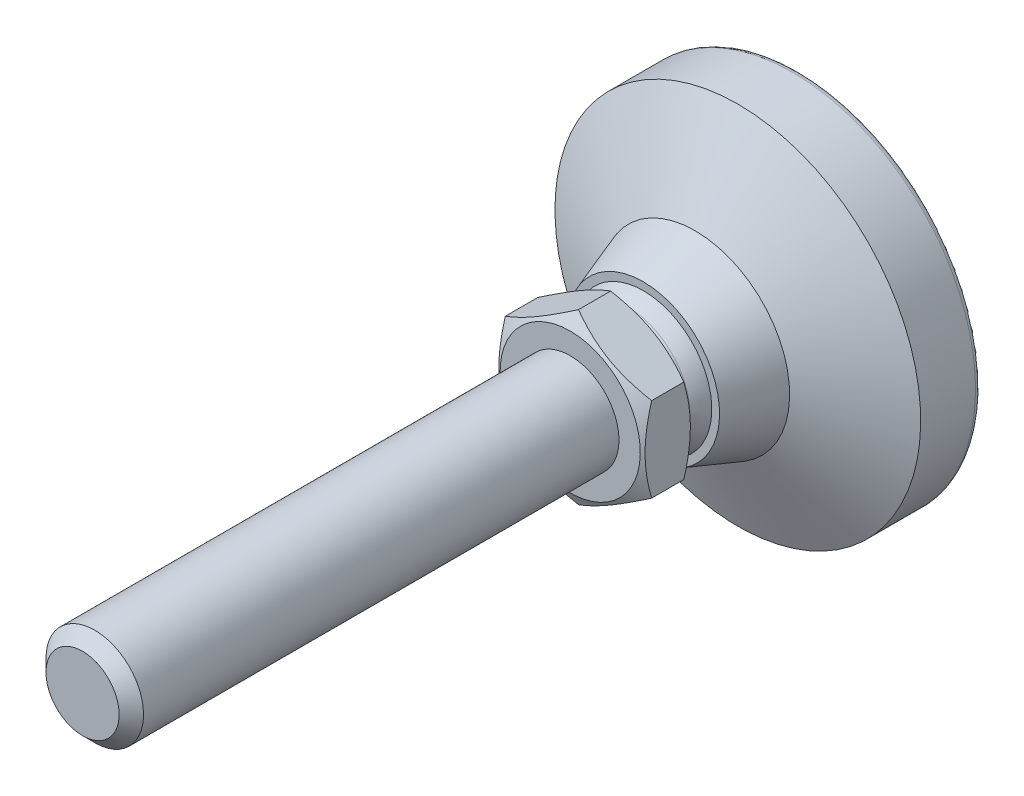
ISO-10303-21;
HEADER;
FILE_DESCRIPTION(('STEP AP214'),'2;1');
FILE_NAME('part.step','',(''),(''),'','','');
FILE_SCHEMA(('AUTOMOTIVE_DESIGN { 1 0 10303 214 1 1 1 1 }'));
ENDSEC;
DATA;
#1=APPLICATION_CONTEXT('core data for automotive mechanical design processes');
#2=APPLICATION_PROTOCOL_DEFINITION('international standard','automotive_design',2000,#1);
#3=PRODUCT_CONTEXT('',#1,'mechanical');
#4=PRODUCT('Part','Part','',(#3));
#5=PRODUCT_RELATED_PRODUCT_CATEGORY('part','',(#4));
#6=PRODUCT_DEFINITION_FORMATION('','',#4);
#7=PRODUCT_DEFINITION_CONTEXT('part definition',#1,'design');
#8=PRODUCT_DEFINITION('design','',#6,#7);
#9=PRODUCT_DEFINITION_SHAPE('','',#8);
#10=(LENGTH_UNIT() NAMED_UNIT(*) SI_UNIT(.MILLI.,.METRE.));
#11=(NAMED_UNIT(*) PLANE_ANGLE_UNIT() SI_UNIT($,.RADIAN.));
#12=(NAMED_UNIT(*) SI_UNIT($,.STERADIAN.) SOLID_ANGLE_UNIT());
#13=UNCERTAINTY_MEASURE_WITH_UNIT(LENGTH_MEASURE(1.E-05),#10,'distance_accuracy_value','');
#14=(GEOMETRIC_REPRESENTATION_CONTEXT(3) GLOBAL_UNCERTAINTY_ASSIGNED_CONTEXT((#13)) GLOBAL_UNIT_ASSIGNED_CONTEXT((#10,
#11,#12)) REPRESENTATION_CONTEXT('',''));
#15=CARTESIAN_POINT('',(0.,0.,0.));
#16=DIRECTION('',(0.,0.,1.));
#17=DIRECTION('',(1.,0.,0.));
#18=AXIS2_PLACEMENT_3D('',#15,#16,#17);
#19=CARTESIAN_POINT('',(-11.0000001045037,0.,29.4999999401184));
#20=DIRECTION('',(0.,0.,1.));
#21=DIRECTION('',(0.,-1.,0.));
#22=AXIS2_PLACEMENT_3D('',#19,#20,#21);
#23=PLANE('',#22);
#24=CARTESIAN_POINT('',(0.,0.,29.4999999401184));
#25=DIRECTION('',(0.,0.,-1.));
#26=DIRECTION('',(0.,1.,0.));
#27=AXIS2_PLACEMENT_3D('',#24,#25,#26);
#28=CIRCLE('',#27,11.5);
#29=CARTESIAN_POINT('',(0.,11.5,29.4999999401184));
#30=VERTEX_POINT('',#29);
#31=EDGE_CURVE('E79',#30,#30,#28,.T.);
#32=ORIENTED_EDGE('',*,*,#31,.T.);
#33=EDGE_LOOP('',(#32));
#34=FACE_BOUND('',#33,.T.);
#35=CARTESIAN_POINT('',(0.,0.,29.4999999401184));
#36=DIRECTION('',(0.,0.,-1.));
#37=DIRECTION('',(0.,1.,0.));
#38=AXIS2_PLACEMENT_3D('',#35,#36,#37);
#39=CIRCLE('',#38,11.0000001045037);
#40=CARTESIAN_POINT('',(0.,11.0000001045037,29.4999999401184));
#41=VERTEX_POINT('',#40);
#42=EDGE_CURVE('E73',#41,#41,#39,.T.);
#43=ORIENTED_EDGE('',*,*,#42,.F.);
#44=EDGE_LOOP('',(#43));
#45=FACE_BOUND('',#44,.T.);
#46=ADVANCED_FACE('F14',(#34,#45),#23,.F.);
#47=CARTESIAN_POINT('',(0.,0.,28.5000000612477));
#48=DIRECTION('',(0.,0.,-1.));
#49=DIRECTION('',(0.,1.,0.));
#50=AXIS2_PLACEMENT_3D('',#47,#48,#49);
#51=TOROIDAL_SURFACE('',#50,11.0000001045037,0.999999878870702);
#52=CARTESIAN_POINT('',(0.,0.,27.9943613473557));
#53=DIRECTION('',(0.,0.,-1.));
#54=DIRECTION('',(0.,1.,0.));
#55=AXIS2_PLACEMENT_3D('',#52,#53,#54);
#56=CIRCLE('',#55,10.1372549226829);
#57=CARTESIAN_POINT('',(-10.1372549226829,0.,27.9943613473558));
#58=VERTEX_POINT('',#57);
#59=EDGE_CURVE('E123',#58,#58,#56,.T.);
#60=ORIENTED_EDGE('',*,*,#59,.F.);
#61=EDGE_LOOP('',(#60));
#62=FACE_BOUND('',#61,.T.);
#63=ORIENTED_EDGE('',*,*,#42,.T.);
#64=EDGE_LOOP('',(#63));
#65=FACE_BOUND('',#64,.T.);
#66=ADVANCED_FACE('F232',(#62,#65),#51,.F.);
#67=CARTESIAN_POINT('',(0.,0.,22.053102));
#68=DIRECTION('',(0.,0.,-1.));
#69=DIRECTION('',(-1.,0.,0.));
#70=AXIS2_PLACEMENT_3D('',#67,#68,#69);
#71=SPHERICAL_SURFACE('',#70,11.75);
#72=CARTESIAN_POINT('',(0.,0.,25.5000004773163));
#73=DIRECTION('',(0.,0.,-1.));
#74=DIRECTION('',(0.,1.,0.));
#75=AXIS2_PLACEMENT_3D('',#72,#73,#74);
#76=CIRCLE('',#75,11.2330490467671);
#77=CARTESIAN_POINT('',(-11.2330490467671,0.,25.5000004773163));
#78=VERTEX_POINT('',#77);
#79=EDGE_CURVE('E120',#78,#78,#76,.T.);
#80=CARTESIAN_POINT('',(-11.2330490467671,0.,25.5000004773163));
#81=CARTESIAN_POINT('',(-11.2247050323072,0.,25.5271926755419));
#82=CARTESIAN_POINT('',(-11.2162622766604,0.,25.5543545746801));
#83=CARTESIAN_POINT('',(-11.1991797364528,0.,25.6086163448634));
#84=CARTESIAN_POINT('',(-11.190539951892,0.,25.6357162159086));
#85=CARTESIAN_POINT('',(-11.1730638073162,0.,25.6898524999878));
#86=CARTESIAN_POINT('',(-11.1642274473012,0.,25.7168889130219));
#87=CARTESIAN_POINT('',(-11.1463586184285,0.,25.7708968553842));
#88=CARTESIAN_POINT('',(-11.1373261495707,0.,25.7978683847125));
#89=CARTESIAN_POINT('',(-11.1190655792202,0.,25.8517451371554));
#90=CARTESIAN_POINT('',(-11.1098374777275,0.,25.8786503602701));
#91=CARTESIAN_POINT('',(-11.0911861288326,0.,25.9323930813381));
#92=CARTESIAN_POINT('',(-11.0817628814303,0.,25.9592305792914));
#93=CARTESIAN_POINT('',(-11.0627217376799,0.,26.0128364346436));
#94=CARTESIAN_POINT('',(-11.0531038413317,0.,26.0396047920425));
#95=CARTESIAN_POINT('',(-11.0336739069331,0.,26.0930709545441));
#96=CARTESIAN_POINT('',(-11.0238618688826,0.,26.1197687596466));
#97=CARTESIAN_POINT('',(-11.0040441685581,0.,26.1730924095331));
#98=CARTESIAN_POINT('',(-10.994038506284,0.,26.1997182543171));
#99=CARTESIAN_POINT('',(-10.9738340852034,0.,26.2528965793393));
#100=CARTESIAN_POINT('',(-10.963635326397,0.,26.2794490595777));
#101=CARTESIAN_POINT('',(-10.9430452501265,0.,26.332479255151));
#102=CARTESIAN_POINT('',(-10.9326539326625,0.,26.358956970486));
#103=CARTESIAN_POINT('',(-10.9116792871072,0.,26.411836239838));
#104=CARTESIAN_POINT('',(-10.9010959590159,0.,26.438237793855));
#105=CARTESIAN_POINT('',(-10.8797378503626,0.,26.4909633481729));
#106=CARTESIAN_POINT('',(-10.8689630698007,0.,26.5172873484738));
#107=CARTESIAN_POINT('',(-10.8472226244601,0.,26.5698564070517));
#108=CARTESIAN_POINT('',(-10.8362569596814,0.,26.5961014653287));
#109=CARTESIAN_POINT('',(-10.8141353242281,0.,26.6485112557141));
#110=CARTESIAN_POINT('',(-10.8029793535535,0.,26.6746759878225));
#111=CARTESIAN_POINT('',(-10.7804776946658,0.,26.7269237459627));
#112=CARTESIAN_POINT('',(-10.7691320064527,0.,26.7530067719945));
#113=CARTESIAN_POINT('',(-10.7462515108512,0.,26.8050897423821));
#114=CARTESIAN_POINT('',(-10.7347167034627,0.,26.831089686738));
#115=CARTESIAN_POINT('',(-10.7114585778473,0.,26.8830051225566));
#116=CARTESIAN_POINT('',(-10.6997352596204,0.,26.9089206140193));
#117=CARTESIAN_POINT('',(-10.6761007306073,0.,26.9606657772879));
#118=CARTESIAN_POINT('',(-10.6641895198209,0.,26.9864954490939));
#119=CARTESIAN_POINT('',(-10.6401798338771,0.,27.0380676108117));
#120=CARTESIAN_POINT('',(-10.6280813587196,0.,27.0638101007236));
#121=CARTESIAN_POINT('',(-10.6036977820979,0.,27.1152065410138));
#122=CARTESIAN_POINT('',(-10.5914126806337,0.,27.1408604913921));
#123=CARTESIAN_POINT('',(-10.5666564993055,0.,27.1920784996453));
#124=CARTESIAN_POINT('',(-10.5541854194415,0.,27.2176425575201));
#125=CARTESIAN_POINT('',(-10.5290579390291,0.,27.268679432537));
#126=CARTESIAN_POINT('',(-10.5164015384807,0.,27.2941522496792));
#127=CARTESIAN_POINT('',(-10.4909040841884,0.,27.3450052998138));
#128=CARTESIAN_POINT('',(-10.4780630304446,0.,27.3703855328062));
#129=CARTESIAN_POINT('',(-10.4521969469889,0.,27.4210520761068));
#130=CARTESIAN_POINT('',(-10.439171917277,0.,27.446338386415));
#131=CARTESIAN_POINT('',(-10.4129385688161,0.,27.4968157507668));
#132=CARTESIAN_POINT('',(-10.3997302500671,0.,27.5220068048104));
#133=CARTESIAN_POINT('',(-10.3731310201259,0.,27.572292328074));
#134=CARTESIAN_POINT('',(-10.3597401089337,0.,27.5973867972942));
#135=CARTESIAN_POINT('',(-10.3327764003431,0.,27.6474778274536));
#136=CARTESIAN_POINT('',(-10.3192036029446,0.,27.6724743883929));
#137=CARTESIAN_POINT('',(-10.2918768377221,0.,27.7223682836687));
#138=CARTESIAN_POINT('',(-10.2781228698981,0.,27.7472656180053));
#139=CARTESIAN_POINT('',(-10.2504344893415,0.,27.7969597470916));
#140=CARTESIAN_POINT('',(-10.2365000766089,0.,27.8217565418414));
#141=CARTESIAN_POINT('',(-10.2084515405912,0.,27.8712482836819));
#142=CARTESIAN_POINT('',(-10.1943374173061,0.,27.8959432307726));
#143=CARTESIAN_POINT('',(-10.1659302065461,0.,27.9452299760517));
#144=CARTESIAN_POINT('',(-10.1516371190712,0.,27.9698217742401));
#145=CARTESIAN_POINT('',(-10.1372549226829,0.,27.9943613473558));
#146=B_SPLINE_CURVE_WITH_KNOTS('',3,(#80,#81,#82,#83,#84,#85,#86,#87,#88,#89,#90,#91,#92,#93,
#94,#95,#96,#97,#98,#99,#100,#101,#102,#103,#104,#105,#106,#107,#108,#109,#110,#111,#112,#113,
#114,#115,#116,#117,#118,#119,#120,#121,#122,#123,#124,#125,#126,#127,#128,#129,#130,#131,#132,
#133,#134,#135,#136,#137,#138,#139,#140,#141,#142,#143,#144,#145),.UNSPECIFIED.,.F.,.F.,(4,2,2,
2,2,2,2,2,2,2,2,2,2,2,2,2,2,2,2,2,2,2,2,2,2,2,2,2,2,2,2,2,4),(0.,0.0853306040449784,
0.170661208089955,0.255991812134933,0.341322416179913,0.42665302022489,0.511983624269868,
0.597314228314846,0.682644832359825,0.767975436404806,0.853306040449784,0.93863664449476,
1.02396724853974,1.10929785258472,1.19462845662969,1.27995906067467,1.36528966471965,
1.45062026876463,1.53595087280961,1.62128147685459,1.70661208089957,1.79194268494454,
1.87727328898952,1.9626038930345,2.04793449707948,2.13326510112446,2.21859570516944,
2.30392630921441,2.38925691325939,2.47458751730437,2.55991812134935,2.64524872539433,
2.73057932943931),.UNSPECIFIED.);
#147=EDGE_CURVE('BSEAM238',#78,#58,#146,.T.);
#148=ORIENTED_EDGE('',*,*,#79,.F.);
#149=ORIENTED_EDGE('',*,*,#59,.T.);
#150=ORIENTED_EDGE('',*,*,#147,.T.);
#151=ORIENTED_EDGE('',*,*,#147,.F.);
#152=EDGE_LOOP('',(#148,#150,#149,#151));
#153=FACE_BOUND('',#152,.T.);
#154=ADVANCED_FACE('F238',(#153),#71,.T.);
#155=CARTESIAN_POINT('',(-11.2330490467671,0.,25.5000004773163));
#156=DIRECTION('',(0.,0.,-1.));
#157=DIRECTION('',(0.,1.,0.));
#158=AXIS2_PLACEMENT_3D('',#155,#156,#157);
#159=PLANE('',#158);
#160=CARTESIAN_POINT('',(0.,0.,25.5));
#161=DIRECTION('',(0.,0.,-1.));
#162=DIRECTION('',(0.,1.,0.));
#163=AXIS2_PLACEMENT_3D('',#160,#161,#162);
#164=CIRCLE('',#163,12.5);
#165=CARTESIAN_POINT('',(0.,12.5,25.5));
#166=VERTEX_POINT('',#165);
#167=EDGE_CURVE('E117',#166,#166,#164,.T.);
#168=ORIENTED_EDGE('',*,*,#167,.F.);
#169=EDGE_LOOP('',(#168));
#170=FACE_BOUND('',#169,.T.);
#171=ORIENTED_EDGE('',*,*,#79,.T.);
#172=EDGE_LOOP('',(#171));
#173=FACE_BOUND('',#172,.T.);
#174=ADVANCED_FACE('F358',(#170,#173),#159,.F.);
#175=CARTESIAN_POINT('',(0.,0.,25.5));
#176=DIRECTION('',(0.,0.,-1.));
#177=DIRECTION('',(0.,1.,0.));
#178=AXIS2_PLACEMENT_3D('',#175,#176,#177);
#179=CONICAL_SURFACE('',#178,12.5,0.339292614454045);
#180=CARTESIAN_POINT('',(0.,0.,17.));
#181=DIRECTION('',(0.,0.,-1.));
#182=DIRECTION('',(0.,1.,0.));
#183=AXIS2_PLACEMENT_3D('',#180,#181,#182);
#184=CIRCLE('',#183,15.5);
#185=CARTESIAN_POINT('',(0.,15.5,17.));
#186=VERTEX_POINT('',#185);
#187=EDGE_CURVE('E114',#186,#186,#184,.T.);
#188=ORIENTED_EDGE('',*,*,#187,.F.);
#189=EDGE_LOOP('',(#188));
#190=FACE_BOUND('',#189,.T.);
#191=ORIENTED_EDGE('',*,*,#167,.T.);
#192=EDGE_LOOP('',(#191));
#193=FACE_BOUND('',#192,.T.);
#194=ADVANCED_FACE('F349',(#190,#193),#179,.T.);
#195=CARTESIAN_POINT('',(0.,0.,17.));
#196=DIRECTION('',(0.,0.,-1.));
#197=DIRECTION('',(0.,1.,0.));
#198=AXIS2_PLACEMENT_3D('',#195,#196,#197);
#199=CONICAL_SURFACE('',#198,15.5,1.12103671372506);
#200=CARTESIAN_POINT('',(0.,0.,10.));
#201=DIRECTION('',(0.,0.,-1.));
#202=DIRECTION('',(0.,1.,0.));
#203=AXIS2_PLACEMENT_3D('',#200,#201,#202);
#204=CIRCLE('',#203,30.);
#205=CARTESIAN_POINT('',(0.,30.,10.));
#206=VERTEX_POINT('',#205);
#207=EDGE_CURVE('E111',#206,#206,#204,.T.);
#208=ORIENTED_EDGE('',*,*,#207,.F.);
#209=EDGE_LOOP('',(#208));
#210=FACE_BOUND('',#209,.T.);
#211=ORIENTED_EDGE('',*,*,#187,.T.);
#212=EDGE_LOOP('',(#211));
#213=FACE_BOUND('',#212,.T.);
#214=ADVANCED_FACE('F340',(#210,#213),#199,.T.);
#215=CARTESIAN_POINT('',(0.,0.,0.));
#216=DIRECTION('',(0.,0.,-1.));
#217=DIRECTION('',(0.,1.,0.));
#218=AXIS2_PLACEMENT_3D('',#215,#216,#217);
#219=CYLINDRICAL_SURFACE('',#218,30.);
#220=CARTESIAN_POINT('',(0.,0.,1.));
#221=DIRECTION('',(0.,0.,-1.));
#222=DIRECTION('',(0.,1.,0.));
#223=AXIS2_PLACEMENT_3D('',#220,#221,#222);
#224=CIRCLE('',#223,30.);
#225=CARTESIAN_POINT('',(0.,30.,1.));
#226=VERTEX_POINT('',#225);
#227=EDGE_CURVE('E88',#226,#226,#224,.T.);
#228=ORIENTED_EDGE('',*,*,#227,.F.);
#229=EDGE_LOOP('',(#228));
#230=FACE_BOUND('',#229,.T.);
#231=ORIENTED_EDGE('',*,*,#207,.T.);
#232=EDGE_LOOP('',(#231));
#233=FACE_BOUND('',#232,.T.);
#234=ADVANCED_FACE('F330',(#230,#233),#219,.T.);
#235=CARTESIAN_POINT('',(0.,0.,1.));
#236=DIRECTION('',(0.,0.,-1.));
#237=DIRECTION('',(0.,1.,0.));
#238=AXIS2_PLACEMENT_3D('',#235,#236,#237);
#239=TOROIDAL_SURFACE('',#238,29.,1.);
#240=CARTESIAN_POINT('',(0.,0.,0.));
#241=DIRECTION('',(0.,0.,-1.));
#242=DIRECTION('',(0.,1.,0.));
#243=AXIS2_PLACEMENT_3D('',#240,#241,#242);
#244=CIRCLE('',#243,29.);
#245=CARTESIAN_POINT('',(0.,29.,0.));
#246=VERTEX_POINT('',#245);
#247=EDGE_CURVE('E85',#246,#246,#244,.T.);
#248=ORIENTED_EDGE('',*,*,#247,.F.);
#249=EDGE_LOOP('',(#248));
#250=FACE_BOUND('',#249,.T.);
#251=ORIENTED_EDGE('',*,*,#227,.T.);
#252=EDGE_LOOP('',(#251));
#253=FACE_BOUND('',#252,.T.);
#254=ADVANCED_FACE('F325',(#250,#253),#239,.T.);
#255=CARTESIAN_POINT('',(-29.,0.,0.));
#256=DIRECTION('',(0.,0.,1.));
#257=DIRECTION('',(0.,-1.,0.));
#258=AXIS2_PLACEMENT_3D('',#255,#256,#257);
#259=PLANE('',#258);
#260=ORIENTED_EDGE('',*,*,#247,.T.);
#261=EDGE_LOOP('',(#260));
#262=FACE_BOUND('',#261,.T.);
#263=ADVANCED_FACE('F141',(#262),#259,.F.);
#264=CARTESIAN_POINT('',(0.,0.,31.6858038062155));
#265=DIRECTION('',(0.,0.,1.));
#266=DIRECTION('',(0.,-1.,0.));
#267=AXIS2_PLACEMENT_3D('',#264,#265,#266);
#268=CONICAL_SURFACE('',#267,15.2859233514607,1.04719755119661);
#269=CARTESIAN_POINT('',(-12.0002,6.92808776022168,30.8605385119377));
#270=CARTESIAN_POINT('',(-11.7364142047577,7.08038456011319,30.7726247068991));
#271=CARTESIAN_POINT('',(-11.4716448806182,7.23324920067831,30.6887010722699));
#272=CARTESIAN_POINT('',(-10.9399829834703,7.54020434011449,30.529941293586));
#273=CARTESIAN_POINT('',(-10.6730897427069,7.69429522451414,30.4551081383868));
#274=CARTESIAN_POINT('',(-9.86810959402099,8.15905073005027,30.2456926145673));
#275=CARTESIAN_POINT('',(-9.32684492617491,8.47155003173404,30.126578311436));
#276=CARTESIAN_POINT('',(-8.51686717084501,8.93919090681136,29.9869061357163));
#277=CARTESIAN_POINT('',(-8.25057389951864,9.09293539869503,29.9471188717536));
#278=CARTESIAN_POINT('',(-7.71675440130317,9.4011362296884,29.8803984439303));
#279=CARTESIAN_POINT('',(-7.44922815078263,9.55559258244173,29.853465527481));
#280=CARTESIAN_POINT('',(-6.91372963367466,9.86476279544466,29.8131436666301));
#281=CARTESIAN_POINT('',(-6.64575827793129,10.0194761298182,29.7997386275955));
#282=CARTESIAN_POINT('',(-6.10956726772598,10.3290461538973,29.7867581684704));
#283=CARTESIAN_POINT('',(-5.84134762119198,10.4839028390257,29.787182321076));
#284=CARTESIAN_POINT('',(-5.33991062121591,10.7734076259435,29.800895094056));
#285=CARTESIAN_POINT('',(-5.10665750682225,10.908076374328,29.8125110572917));
#286=CARTESIAN_POINT('',(-4.64068775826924,11.1771041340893,29.8459830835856));
#287=CARTESIAN_POINT('',(-4.40797116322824,11.3114631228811,29.8678398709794));
#288=CARTESIAN_POINT('',(-3.94320092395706,11.5797983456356,29.9214124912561));
#289=CARTESIAN_POINT('',(-3.711147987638,11.7137741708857,29.9531364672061));
#290=CARTESIAN_POINT('',(-3.24813003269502,11.9810977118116,30.0258868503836));
#291=CARTESIAN_POINT('',(-3.01716508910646,12.1144453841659,30.0669138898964));
#292=CARTESIAN_POINT('',(-2.31605804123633,12.5192297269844,30.204986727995));
#293=CARTESIAN_POINT('',(-1.84794625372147,12.789494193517,30.3157999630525));
#294=CARTESIAN_POINT('',(-0.918702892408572,13.3259930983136,30.5673008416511));
#295=CARTESIAN_POINT('',(-0.457559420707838,13.5922344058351,30.7079294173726));
#296=CARTESIAN_POINT('',(0.000200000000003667,13.8565219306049,30.8605385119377));
#297=B_SPLINE_CURVE_WITH_KNOTS('',3,(#269,#270,#271,#272,#273,#274,#275,#276,#277,#278,#279,
#280,#281,#282,#283,#284,#285,#286,#287,#288,#289,#290,#291,#292,#293,#294,#295,#296),
.UNSPECIFIED.,.F.,.F.,(4,2,2,2,2,2,2,2,2,2,2,2,2,4),(0.,0.951004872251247,1.90232158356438,
3.80900466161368,4.73894551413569,5.66890426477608,6.59775529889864,7.52657763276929,
8.33514643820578,9.14377244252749,9.95306755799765,10.7624176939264,12.4167102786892,
14.0677556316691),.UNSPECIFIED.);
#298=CARTESIAN_POINT('',(-12.,6.92820323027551,30.8604718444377));
#299=VERTEX_POINT('',#298);
#300=CARTESIAN_POINT('',(0.,13.856406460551,30.8604718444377));
#301=VERTEX_POINT('',#300);
#302=EDGE_CURVE('E29',#299,#301,#297,.T.);
#303=ORIENTED_EDGE('',*,*,#302,.T.);
#304=CARTESIAN_POINT('',(-0.000199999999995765,13.8565219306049,30.8605385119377));
#305=CARTESIAN_POINT('',(0.263585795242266,13.7042251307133,30.7726247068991));
#306=CARTESIAN_POINT('',(0.528355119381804,13.5513604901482,30.6887010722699));
#307=CARTESIAN_POINT('',(1.06001701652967,13.244405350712,30.529941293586));
#308=CARTESIAN_POINT('',(1.32691025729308,13.0903144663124,30.4551081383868));
#309=CARTESIAN_POINT('',(2.13189040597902,12.6255589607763,30.2456926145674));
#310=CARTESIAN_POINT('',(2.67315507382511,12.3130596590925,30.1265783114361));
#311=CARTESIAN_POINT('',(3.483132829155,11.8454187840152,29.9869061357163));
#312=CARTESIAN_POINT('',(3.74942610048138,11.6916742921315,29.9471188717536));
#313=CARTESIAN_POINT('',(4.28324559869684,11.3834734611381,29.8803984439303));
#314=CARTESIAN_POINT('',(4.55077184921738,11.2290171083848,29.853465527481));
#315=CARTESIAN_POINT('',(5.08627036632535,10.9198468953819,29.8131436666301));
#316=CARTESIAN_POINT('',(5.35424172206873,10.7651335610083,29.7997386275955));
#317=CARTESIAN_POINT('',(5.89043273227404,10.4555635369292,29.7867581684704));
#318=CARTESIAN_POINT('',(6.15865237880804,10.3007068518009,29.787182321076));
#319=CARTESIAN_POINT('',(6.66008937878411,10.0112020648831,29.800895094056));
#320=CARTESIAN_POINT('',(6.89334249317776,9.87653331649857,29.8125110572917));
#321=CARTESIAN_POINT('',(7.35931224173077,9.60750555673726,29.8459830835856));
#322=CARTESIAN_POINT('',(7.59202883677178,9.47314656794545,29.8678398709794));
#323=CARTESIAN_POINT('',(8.05679907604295,9.20481134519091,29.9214124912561));
#324=CARTESIAN_POINT('',(8.28885201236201,9.07083551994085,29.9531364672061));
#325=CARTESIAN_POINT('',(8.75186996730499,8.80351197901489,30.0258868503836));
#326=CARTESIAN_POINT('',(8.98283491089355,8.67016430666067,30.0669138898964));
#327=CARTESIAN_POINT('',(9.68394195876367,8.26537996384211,30.204986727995));
#328=CARTESIAN_POINT('',(10.1520537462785,7.99511549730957,30.3157999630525));
#329=CARTESIAN_POINT('',(11.0812971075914,7.45861659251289,30.5673008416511));
#330=CARTESIAN_POINT('',(11.5424405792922,7.19237528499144,30.7079294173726));
#331=CARTESIAN_POINT('',(12.0002,6.92808776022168,30.8605385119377));
#332=B_SPLINE_CURVE_WITH_KNOTS('',3,(#304,#305,#306,#307,#308,#309,#310,#311,#312,#313,#314,
#315,#316,#317,#318,#319,#320,#321,#322,#323,#324,#325,#326,#327,#328,#329,#330,#331),
.UNSPECIFIED.,.F.,.F.,(4,2,2,2,2,2,2,2,2,2,2,2,2,4),(0.,0.951004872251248,1.90232158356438,
3.80900466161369,4.7389455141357,5.66890426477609,6.59775529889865,7.5265776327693,
8.33514643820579,9.1437724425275,9.95306755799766,10.7624176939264,12.4167102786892,
14.0677556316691),.UNSPECIFIED.);
#333=CARTESIAN_POINT('',(12.,6.92820323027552,30.8604718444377));
#334=VERTEX_POINT('',#333);
#335=EDGE_CURVE('E66',#301,#334,#332,.T.);
#336=ORIENTED_EDGE('',*,*,#335,.T.);
#337=CARTESIAN_POINT('',(12.,18.4491557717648,35.5670495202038));
#338=CARTESIAN_POINT('',(12.,18.1877661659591,35.4405449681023));
#339=CARTESIAN_POINT('',(12.,17.9260654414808,35.3146835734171));
#340=CARTESIAN_POINT('',(12.,17.401976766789,35.064393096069));
#341=CARTESIAN_POINT('',(12.,17.1395888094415,34.9399640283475));
#342=CARTESIAN_POINT('',(12.,16.3512244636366,34.5690104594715));
#343=CARTESIAN_POINT('',(12.,15.8241274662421,34.3248583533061));
#344=CARTESIAN_POINT('',(12.,14.7634053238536,33.8430387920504));
#345=CARTESIAN_POINT('',(12.,14.2297601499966,33.6054153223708));
#346=CARTESIAN_POINT('',(12.,13.1581690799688,33.1401065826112));
#347=CARTESIAN_POINT('',(12.,12.6202233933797,32.9124208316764));
#348=CARTESIAN_POINT('',(12.,11.5224579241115,32.4627752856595));
#349=CARTESIAN_POINT('',(12.,10.9624758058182,32.2412097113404));
#350=CARTESIAN_POINT('',(12.,9.83589698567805,31.815239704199));
#351=CARTESIAN_POINT('',(12.,9.26929954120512,31.610837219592));
#352=CARTESIAN_POINT('',(12.,8.12972111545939,31.2246803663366));
#353=CARTESIAN_POINT('',(12.,7.55675628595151,31.0428787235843));
#354=CARTESIAN_POINT('',(12.,6.4025552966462,30.7078536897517));
#355=CARTESIAN_POINT('',(12.,5.82132185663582,30.5546211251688));
#356=CARTESIAN_POINT('',(12.,4.94477695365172,30.3522375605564));
#357=CARTESIAN_POINT('',(12.,4.65258618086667,30.2894830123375));
#358=CARTESIAN_POINT('',(12.,4.06623904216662,30.1738927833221));
#359=CARTESIAN_POINT('',(12.,3.77208271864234,30.121056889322));
#360=CARTESIAN_POINT('',(12.,3.18201834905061,30.026246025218));
#361=CARTESIAN_POINT('',(12.,2.8861103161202,29.9842709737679));
#362=CARTESIAN_POINT('',(12.,2.29287001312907,29.9120250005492));
#363=CARTESIAN_POINT('',(12.,1.99553779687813,29.8817536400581));
#364=CARTESIAN_POINT('',(12.,1.40367554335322,29.8338871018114));
#365=CARTESIAN_POINT('',(12.,1.1091582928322,29.8161347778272));
#366=CARTESIAN_POINT('',(12.,0.519638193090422,29.7930890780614));
#367=CARTESIAN_POINT('',(12.,0.224635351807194,29.7877955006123));
#368=CARTESIAN_POINT('',(12.,-0.365331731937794,29.7897927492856));
#369=CARTESIAN_POINT('',(12.,-0.660295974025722,29.7970836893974));
#370=CARTESIAN_POINT('',(12.,-1.24965982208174,29.8240749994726));
#371=CARTESIAN_POINT('',(12.,-1.54405940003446,29.8437759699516));
#372=CARTESIAN_POINT('',(12.,-2.2565344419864,29.906059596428));
#373=CARTESIAN_POINT('',(12.,-2.67408031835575,29.9548043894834));
#374=CARTESIAN_POINT('',(12.,-3.5059686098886,30.0745634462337));
#375=CARTESIAN_POINT('',(12.,-3.92031056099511,30.1455808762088));
#376=CARTESIAN_POINT('',(12.,-4.74543197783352,30.3073585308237));
#377=CARTESIAN_POINT('',(12.,-5.15620830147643,30.3981346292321));
#378=CARTESIAN_POINT('',(12.,-5.97358990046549,30.5966691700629));
#379=CARTESIAN_POINT('',(12.,-6.38019524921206,30.704427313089));
#380=CARTESIAN_POINT('',(12.,-7.19808575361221,30.936835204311));
#381=CARTESIAN_POINT('',(12.,-7.60928038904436,31.0618013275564));
#382=CARTESIAN_POINT('',(12.,-8.42761754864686,31.3242965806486));
#383=CARTESIAN_POINT('',(12.,-8.83476004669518,31.461825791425));
#384=CARTESIAN_POINT('',(12.,-9.64520027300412,31.7472942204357));
#385=CARTESIAN_POINT('',(12.,-10.0484993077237,31.8952297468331));
#386=CARTESIAN_POINT('',(12.,-10.8517789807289,32.1998046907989));
#387=CARTESIAN_POINT('',(12.,-11.2517596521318,32.3564440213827));
#388=CARTESIAN_POINT('',(12.,-12.1712967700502,32.7262469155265));
#389=CARTESIAN_POINT('',(12.,-12.6898161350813,32.9419848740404));
#390=CARTESIAN_POINT('',(12.,-13.7226553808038,33.3833163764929));
#391=CARTESIAN_POINT('',(12.,-14.2369750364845,33.60891044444));
#392=CARTESIAN_POINT('',(12.,-15.2621664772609,34.0680449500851));
#393=CARTESIAN_POINT('',(12.,-15.7730375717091,34.3015869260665));
#394=CARTESIAN_POINT('',(12.,-16.7917880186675,34.7750688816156));
#395=CARTESIAN_POINT('',(12.,-17.2996674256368,35.0150087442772));
#396=CARTESIAN_POINT('',(12.,-18.3134153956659,35.5003675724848));
#397=CARTESIAN_POINT('',(12.,-18.8192814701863,35.7457917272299));
#398=CARTESIAN_POINT('',(12.,-19.8288855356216,36.240977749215));
#399=CARTESIAN_POINT('',(12.,-20.332623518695,36.4907396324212));
#400=CARTESIAN_POINT('',(12.,-21.3382321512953,36.9938506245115));
#401=CARTESIAN_POINT('',(12.,-21.8401030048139,37.2471993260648));
#402=CARTESIAN_POINT('',(12.,-22.8422969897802,37.7569413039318));
#403=CARTESIAN_POINT('',(12.,-23.342620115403,38.0133345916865));
#404=CARTESIAN_POINT('',(12.,-24.7618922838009,38.7452634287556));
#405=CARTESIAN_POINT('',(12.,-25.6792591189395,39.2238670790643));
#406=CARTESIAN_POINT('',(12.,-27.5105752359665,40.1876216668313));
#407=CARTESIAN_POINT('',(12.,-28.4245244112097,40.6727728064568));
#408=CARTESIAN_POINT('',(12.,-30.2476486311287,41.6470046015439));
#409=CARTESIAN_POINT('',(12.,-31.1568298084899,42.1360737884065));
#410=CARTESIAN_POINT('',(12.,-32.5189771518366,42.872623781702));
#411=CARTESIAN_POINT('',(12.,-32.9727443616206,43.1186253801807));
#412=CARTESIAN_POINT('',(12.,-33.8797970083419,43.6115135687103));
#413=CARTESIAN_POINT('',(12.,-34.3330824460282,43.8584001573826));
#414=CARTESIAN_POINT('',(12.,-34.7861537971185,44.1056791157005));
#415=B_SPLINE_CURVE_WITH_KNOTS('',3,(#337,#338,#339,#340,#341,#342,#343,#344,#345,#346,#347,
#348,#349,#350,#351,#352,#353,#354,#355,#356,#357,#358,#359,#360,#361,#362,#363,#364,#365,#366,
#367,#368,#369,#370,#371,#372,#373,#374,#375,#376,#377,#378,#379,#380,#381,#382,#383,#384,#385,
#386,#387,#388,#389,#390,#391,#392,#393,#394,#395,#396,#397,#398,#399,#400,#401,#402,#403,#404,
#405,#406,#407,#408,#409,#410,#411,#412,#413,#414),.UNSPECIFIED.,.F.,.F.,(4,2,2,2,2,2,2,2,2,2,2,
2,2,2,2,2,2,2,2,2,2,2,2,2,2,2,2,2,2,2,2,2,2,2,2,2,2,2,4),(0.,0.871176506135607,1.74236209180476,
3.4849995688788,5.23739860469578,6.98971275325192,8.79616385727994,10.6028197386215,
12.4056306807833,14.2078617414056,15.1042819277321,16.0006828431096,16.8970770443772,
17.7934376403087,18.6783360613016,19.5632201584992,20.4481122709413,21.3330472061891,
22.5934906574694,23.854113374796,25.1157526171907,26.3773696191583,27.6664225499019,
28.955483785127,30.2440899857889,31.5326833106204,33.2173759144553,34.9021581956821,
36.5872684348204,38.2723479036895,39.9590956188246,41.6458495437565,43.3324134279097,
45.0189836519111,48.1230718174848,51.2272560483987,54.3243691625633,55.872849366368,
57.4213271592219),.UNSPECIFIED.);
#416=CARTESIAN_POINT('',(12.,-6.9282032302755,30.8604718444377));
#417=VERTEX_POINT('',#416);
#418=EDGE_CURVE('E69',#334,#417,#415,.T.);
#419=ORIENTED_EDGE('',*,*,#418,.T.);
#420=CARTESIAN_POINT('',(12.0002,-6.92808776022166,30.8605385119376));
#421=CARTESIAN_POINT('',(11.7364142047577,-7.08038456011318,30.772624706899));
#422=CARTESIAN_POINT('',(11.4716448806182,-7.2332492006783,30.6887010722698));
#423=CARTESIAN_POINT('',(10.9399829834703,-7.54020434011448,30.529941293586));
#424=CARTESIAN_POINT('',(10.6730897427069,-7.69429522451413,30.4551081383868));
#425=CARTESIAN_POINT('',(9.86810959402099,-8.15905073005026,30.2456926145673));
#426=CARTESIAN_POINT('',(9.3268449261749,-8.47155003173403,30.126578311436));
#427=CARTESIAN_POINT('',(8.51686717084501,-8.93919090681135,29.9869061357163));
#428=CARTESIAN_POINT('',(8.25057389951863,-9.09293539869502,29.9471188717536));
#429=CARTESIAN_POINT('',(7.71675440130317,-9.40113622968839,29.8803984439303));
#430=CARTESIAN_POINT('',(7.44922815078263,-9.55559258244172,29.853465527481));
#431=CARTESIAN_POINT('',(6.91372963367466,-9.86476279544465,29.8131436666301));
#432=CARTESIAN_POINT('',(6.64575827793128,-10.0194761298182,29.7997386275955));
#433=CARTESIAN_POINT('',(6.10956726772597,-10.3290461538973,29.7867581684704));
#434=CARTESIAN_POINT('',(5.84134762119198,-10.4839028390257,29.787182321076));
#435=CARTESIAN_POINT('',(5.33991062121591,-10.7734076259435,29.800895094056));
#436=CARTESIAN_POINT('',(5.10665750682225,-10.908076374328,29.8125110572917));
#437=CARTESIAN_POINT('',(4.64068775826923,-11.1771041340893,29.8459830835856));
#438=CARTESIAN_POINT('',(4.40797116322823,-11.3114631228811,29.8678398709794));
#439=CARTESIAN_POINT('',(3.94320092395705,-11.5797983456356,29.9214124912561));
#440=CARTESIAN_POINT('',(3.71114798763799,-11.7137741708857,29.9531364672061));
#441=CARTESIAN_POINT('',(3.24813003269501,-11.9810977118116,30.0258868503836));
#442=CARTESIAN_POINT('',(3.01716508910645,-12.1144453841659,30.0669138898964));
#443=CARTESIAN_POINT('',(2.31605804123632,-12.5192297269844,30.204986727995));
#444=CARTESIAN_POINT('',(1.84794625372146,-12.789494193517,30.3157999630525));
#445=CARTESIAN_POINT('',(0.918702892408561,-13.3259930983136,30.5673008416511));
#446=CARTESIAN_POINT('',(0.457559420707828,-13.5922344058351,30.7079294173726));
#447=CARTESIAN_POINT('',(-0.000200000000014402,-13.8565219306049,30.8605385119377));
#448=B_SPLINE_CURVE_WITH_KNOTS('',3,(#420,#421,#422,#423,#424,#425,#426,#427,#428,#429,#430,
#431,#432,#433,#434,#435,#436,#437,#438,#439,#440,#441,#442,#443,#444,#445,#446,#447),
.UNSPECIFIED.,.F.,.F.,(4,2,2,2,2,2,2,2,2,2,2,2,2,4),(0.,0.951004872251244,1.90232158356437,
3.80900466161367,4.73894551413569,5.66890426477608,6.59775529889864,7.52657763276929,
8.33514643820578,9.14377244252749,9.95306755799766,10.7624176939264,12.4167102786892,
14.0677556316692),.UNSPECIFIED.);
#449=CARTESIAN_POINT('',(0.,-13.856406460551,30.8604718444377));
#450=VERTEX_POINT('',#449);
#451=EDGE_CURVE('E78',#417,#450,#448,.T.);
#452=ORIENTED_EDGE('',*,*,#451,.T.);
#453=CARTESIAN_POINT('',(0.000199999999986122,-13.8565219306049,30.8605385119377));
#454=CARTESIAN_POINT('',(-0.263585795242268,-13.7042251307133,30.7726247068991));
#455=CARTESIAN_POINT('',(-0.528355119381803,-13.5513604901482,30.6887010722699));
#456=CARTESIAN_POINT('',(-1.06001701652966,-13.244405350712,30.529941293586));
#457=CARTESIAN_POINT('',(-1.32691025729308,-13.0903144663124,30.4551081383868));
#458=CARTESIAN_POINT('',(-2.13189040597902,-12.6255589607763,30.2456926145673));
#459=CARTESIAN_POINT('',(-2.67315507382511,-12.3130596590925,30.126578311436));
#460=CARTESIAN_POINT('',(-3.483132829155,-11.8454187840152,29.9869061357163));
#461=CARTESIAN_POINT('',(-3.74942610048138,-11.6916742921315,29.9471188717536));
#462=CARTESIAN_POINT('',(-4.28324559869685,-11.3834734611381,29.8803984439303));
#463=CARTESIAN_POINT('',(-4.55077184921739,-11.2290171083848,29.853465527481));
#464=CARTESIAN_POINT('',(-5.08627036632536,-10.9198468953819,29.8131436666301));
#465=CARTESIAN_POINT('',(-5.35424172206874,-10.7651335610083,29.7997386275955));
#466=CARTESIAN_POINT('',(-5.89043273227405,-10.4555635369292,29.7867581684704));
#467=CARTESIAN_POINT('',(-6.15865237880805,-10.3007068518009,29.787182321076));
#468=CARTESIAN_POINT('',(-6.66008937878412,-10.011202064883,29.800895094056));
#469=CARTESIAN_POINT('',(-6.89334249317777,-9.87653331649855,29.8125110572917));
#470=CARTESIAN_POINT('',(-7.35931224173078,-9.60750555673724,29.8459830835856));
#471=CARTESIAN_POINT('',(-7.59202883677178,-9.47314656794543,29.8678398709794));
#472=CARTESIAN_POINT('',(-8.05679907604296,-9.20481134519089,29.9214124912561));
#473=CARTESIAN_POINT('',(-8.28885201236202,-9.07083551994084,29.9531364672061));
#474=CARTESIAN_POINT('',(-8.75186996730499,-8.80351197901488,30.0258868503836));
#475=CARTESIAN_POINT('',(-8.98283491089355,-8.67016430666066,30.0669138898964));
#476=CARTESIAN_POINT('',(-9.68394195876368,-8.2653799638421,30.204986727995));
#477=CARTESIAN_POINT('',(-10.1520537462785,-7.99511549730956,30.3157999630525));
#478=CARTESIAN_POINT('',(-11.0812971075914,-7.45861659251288,30.5673008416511));
#479=CARTESIAN_POINT('',(-11.5424405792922,-7.19237528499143,30.7079294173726));
#480=CARTESIAN_POINT('',(-12.0002,-6.92808776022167,30.8605385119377));
#481=B_SPLINE_CURVE_WITH_KNOTS('',3,(#453,#454,#455,#456,#457,#458,#459,#460,#461,#462,#463,
#464,#465,#466,#467,#468,#469,#470,#471,#472,#473,#474,#475,#476,#477,#478,#479,#480),
.UNSPECIFIED.,.F.,.F.,(4,2,2,2,2,2,2,2,2,2,2,2,2,4),(0.,0.951004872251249,1.90232158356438,
3.80900466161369,4.73894551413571,5.6689042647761,6.59775529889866,7.52657763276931,
8.3351464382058,9.1437724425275,9.95306755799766,10.7624176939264,12.4167102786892,
14.0677556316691),.UNSPECIFIED.);
#482=CARTESIAN_POINT('',(-12.,-6.92820323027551,30.8604718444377));
#483=VERTEX_POINT('',#482);
#484=EDGE_CURVE('E165',#450,#483,#481,.T.);
#485=ORIENTED_EDGE('',*,*,#484,.T.);
#486=CARTESIAN_POINT('',(-12.,18.4491557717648,35.5670495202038));
#487=CARTESIAN_POINT('',(-12.,18.1877661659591,35.4405449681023));
#488=CARTESIAN_POINT('',(-12.,17.9260654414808,35.3146835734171));
#489=CARTESIAN_POINT('',(-12.,17.401976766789,35.064393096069));
#490=CARTESIAN_POINT('',(-12.,17.1395888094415,34.9399640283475));
#491=CARTESIAN_POINT('',(-12.,16.3512244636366,34.5690104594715));
#492=CARTESIAN_POINT('',(-12.,15.8241274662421,34.3248583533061));
#493=CARTESIAN_POINT('',(-12.,14.7634053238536,33.8430387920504));
#494=CARTESIAN_POINT('',(-12.,14.2297601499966,33.6054153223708));
#495=CARTESIAN_POINT('',(-12.,13.1581690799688,33.1401065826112));
#496=CARTESIAN_POINT('',(-12.,12.6202233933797,32.9124208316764));
#497=CARTESIAN_POINT('',(-12.,11.5224579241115,32.4627752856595));
#498=CARTESIAN_POINT('',(-12.,10.9624758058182,32.2412097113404));
#499=CARTESIAN_POINT('',(-12.,9.83589698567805,31.815239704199));
#500=CARTESIAN_POINT('',(-12.,9.26929954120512,31.610837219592));
#501=CARTESIAN_POINT('',(-12.,8.12972111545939,31.2246803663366));
#502=CARTESIAN_POINT('',(-12.,7.55675628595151,31.0428787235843));
#503=CARTESIAN_POINT('',(-12.,6.4025552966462,30.7078536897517));
#504=CARTESIAN_POINT('',(-12.,5.82132185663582,30.5546211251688));
#505=CARTESIAN_POINT('',(-12.,4.94477695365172,30.3522375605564));
#506=CARTESIAN_POINT('',(-12.,4.65258618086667,30.2894830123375));
#507=CARTESIAN_POINT('',(-12.,4.06623904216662,30.1738927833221));
#508=CARTESIAN_POINT('',(-12.,3.77208271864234,30.121056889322));
#509=CARTESIAN_POINT('',(-12.,3.18201834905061,30.026246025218));
#510=CARTESIAN_POINT('',(-12.,2.88611031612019,29.9842709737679));
#511=CARTESIAN_POINT('',(-12.,2.29287001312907,29.9120250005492));
#512=CARTESIAN_POINT('',(-12.,1.99553779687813,29.8817536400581));
#513=CARTESIAN_POINT('',(-12.,1.40367554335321,29.8338871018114));
#514=CARTESIAN_POINT('',(-12.,1.10915829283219,29.8161347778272));
#515=CARTESIAN_POINT('',(-12.,0.519638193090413,29.7930890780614));
#516=CARTESIAN_POINT('',(-12.,0.224635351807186,29.7877955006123));
#517=CARTESIAN_POINT('',(-12.,-0.365331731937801,29.7897927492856));
#518=CARTESIAN_POINT('',(-12.,-0.660295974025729,29.7970836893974));
#519=CARTESIAN_POINT('',(-12.,-1.24965982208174,29.8240749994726));
#520=CARTESIAN_POINT('',(-12.,-1.54405940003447,29.8437759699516));
#521=CARTESIAN_POINT('',(-12.,-2.25653444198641,29.906059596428));
#522=CARTESIAN_POINT('',(-12.,-2.67408031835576,29.9548043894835));
#523=CARTESIAN_POINT('',(-12.,-3.50596860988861,30.0745634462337));
#524=CARTESIAN_POINT('',(-12.,-3.92031056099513,30.1455808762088));
#525=CARTESIAN_POINT('',(-12.,-4.74543197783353,30.3073585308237));
#526=CARTESIAN_POINT('',(-12.,-5.15620830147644,30.3981346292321));
#527=CARTESIAN_POINT('',(-12.,-5.9735899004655,30.5966691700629));
#528=CARTESIAN_POINT('',(-12.,-6.38019524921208,30.7044273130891));
#529=CARTESIAN_POINT('',(-12.,-7.19808575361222,30.936835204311));
#530=CARTESIAN_POINT('',(-12.,-7.60928038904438,31.0618013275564));
#531=CARTESIAN_POINT('',(-12.,-8.42761754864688,31.3242965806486));
#532=CARTESIAN_POINT('',(-12.,-8.83476004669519,31.461825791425));
#533=CARTESIAN_POINT('',(-12.,-9.64520027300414,31.7472942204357));
#534=CARTESIAN_POINT('',(-12.,-10.0484993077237,31.8952297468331));
#535=CARTESIAN_POINT('',(-12.,-10.8517789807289,32.1998046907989));
#536=CARTESIAN_POINT('',(-12.,-11.2517596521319,32.3564440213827));
#537=CARTESIAN_POINT('',(-12.,-12.1712967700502,32.7262469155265));
#538=CARTESIAN_POINT('',(-12.,-12.6898161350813,32.9419848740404));
#539=CARTESIAN_POINT('',(-12.,-13.7226553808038,33.3833163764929));
#540=CARTESIAN_POINT('',(-12.,-14.2369750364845,33.60891044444));
#541=CARTESIAN_POINT('',(-12.,-15.2621664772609,34.0680449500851));
#542=CARTESIAN_POINT('',(-12.,-15.7730375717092,34.3015869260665));
#543=CARTESIAN_POINT('',(-12.,-16.7917880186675,34.7750688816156));
#544=CARTESIAN_POINT('',(-12.,-17.2996674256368,35.0150087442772));
#545=CARTESIAN_POINT('',(-12.,-18.3134153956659,35.5003675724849));
#546=CARTESIAN_POINT('',(-12.,-18.8192814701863,35.7457917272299));
#547=CARTESIAN_POINT('',(-12.,-19.8288855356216,36.240977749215));
#548=CARTESIAN_POINT('',(-12.,-20.3326235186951,36.4907396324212));
#549=CARTESIAN_POINT('',(-12.,-21.3382321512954,36.9938506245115));
#550=CARTESIAN_POINT('',(-12.,-21.8401030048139,37.2471993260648));
#551=CARTESIAN_POINT('',(-12.,-22.8422969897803,37.7569413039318));
#552=CARTESIAN_POINT('',(-12.,-23.342620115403,38.0133345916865));
#553=CARTESIAN_POINT('',(-12.,-24.7618922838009,38.7452634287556));
#554=CARTESIAN_POINT('',(-12.,-25.6792591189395,39.2238670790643));
#555=CARTESIAN_POINT('',(-12.,-27.5105752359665,40.1876216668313));
#556=CARTESIAN_POINT('',(-12.,-28.4245244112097,40.6727728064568));
#557=CARTESIAN_POINT('',(-12.,-30.2476486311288,41.6470046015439));
#558=CARTESIAN_POINT('',(-12.,-31.1568298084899,42.1360737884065));
#559=CARTESIAN_POINT('',(-12.,-32.5189771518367,42.872623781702));
#560=CARTESIAN_POINT('',(-12.,-32.9727443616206,43.1186253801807));
#561=CARTESIAN_POINT('',(-12.,-33.8797970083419,43.6115135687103));
#562=CARTESIAN_POINT('',(-12.,-34.3330824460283,43.8584001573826));
#563=CARTESIAN_POINT('',(-12.,-34.7861537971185,44.1056791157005));
#564=B_SPLINE_CURVE_WITH_KNOTS('',3,(#486,#487,#488,#489,#490,#491,#492,#493,#494,#495,#496,
#497,#498,#499,#500,#501,#502,#503,#504,#505,#506,#507,#508,#509,#510,#511,#512,#513,#514,#515,
#516,#517,#518,#519,#520,#521,#522,#523,#524,#525,#526,#527,#528,#529,#530,#531,#532,#533,#534,
#535,#536,#537,#538,#539,#540,#541,#542,#543,#544,#545,#546,#547,#548,#549,#550,#551,#552,#553,
#554,#555,#556,#557,#558,#559,#560,#561,#562,#563),.UNSPECIFIED.,.F.,.F.,(4,2,2,2,2,2,2,2,2,2,2,
2,2,2,2,2,2,2,2,2,2,2,2,2,2,2,2,2,2,2,2,2,2,2,2,2,2,2,4),(0.,0.871176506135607,1.74236209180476,
3.4849995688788,5.23739860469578,6.98971275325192,8.79616385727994,10.6028197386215,
12.4056306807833,14.2078617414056,15.1042819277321,16.0006828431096,16.8970770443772,
17.7934376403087,18.6783360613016,19.5632201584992,20.4481122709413,21.3330472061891,
22.5934906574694,23.854113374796,25.1157526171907,26.3773696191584,27.6664225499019,
28.9554837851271,30.2440899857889,31.5326833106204,33.2173759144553,34.9021581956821,
36.5872684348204,38.2723479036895,39.9590956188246,41.6458495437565,43.3324134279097,
45.0189836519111,48.1230718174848,51.2272560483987,54.3243691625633,55.8728493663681,
57.4213271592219),.UNSPECIFIED.);
#565=EDGE_CURVE('E172',#483,#299,#564,.F.);
#566=ORIENTED_EDGE('',*,*,#565,.T.);
#567=EDGE_LOOP('',(#303,#336,#419,#452,#485,#566));
#568=FACE_BOUND('',#567,.T.);
#569=ORIENTED_EDGE('',*,*,#31,.F.);
#570=EDGE_LOOP('',(#569));
#571=FACE_BOUND('',#570,.T.);
#572=ADVANCED_FACE('F67',(#568,#571),#268,.T.);
#573=CARTESIAN_POINT('',(-11.5029825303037,0.,37.4999999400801));
#574=DIRECTION('',(0.,0.,-1.));
#575=DIRECTION('',(0.,1.,0.));
#576=AXIS2_PLACEMENT_3D('',#573,#574,#575);
#577=PLANE('',#576);
#578=CARTESIAN_POINT('',(0.,0.,37.4999999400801));
#579=DIRECTION('',(0.,0.,-1.));
#580=DIRECTION('',(-1.,0.,0.));
#581=AXIS2_PLACEMENT_3D('',#578,#579,#580);
#582=CIRCLE('',#581,8.);
#583=CARTESIAN_POINT('',(-8.,0.,37.4999999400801));
#584=VERTEX_POINT('',#583);
#585=EDGE_CURVE('E134',#584,#584,#582,.T.);
#586=ORIENTED_EDGE('',*,*,#585,.T.);
#587=EDGE_LOOP('',(#586));
#588=FACE_BOUND('',#587,.T.);
#589=CARTESIAN_POINT('',(0.,0.,37.4999999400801));
#590=DIRECTION('',(0.,0.,-1.));
#591=DIRECTION('',(0.,1.,0.));
#592=AXIS2_PLACEMENT_3D('',#589,#590,#591);
#593=CIRCLE('',#592,11.5);
#594=CARTESIAN_POINT('',(0.,11.5,37.4999999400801));
#595=VERTEX_POINT('',#594);
#596=EDGE_CURVE('E255',#595,#595,#593,.T.);
#597=ORIENTED_EDGE('',*,*,#596,.F.);
#598=EDGE_LOOP('',(#597));
#599=FACE_BOUND('',#598,.T.);
#600=ADVANCED_FACE('F140',(#588,#599),#577,.F.);
#601=CARTESIAN_POINT('',(0.,0.,37.4999999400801));
#602=DIRECTION('',(0.,0.,-1.));
#603=DIRECTION('',(0.,1.,0.));
#604=AXIS2_PLACEMENT_3D('',#601,#602,#603);
#605=CONICAL_SURFACE('',#604,11.5,1.0471975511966);
#606=CARTESIAN_POINT('',(0.000200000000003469,13.8565219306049,36.1394613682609));
#607=CARTESIAN_POINT('',(-0.263585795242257,13.7042251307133,36.2273751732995));
#608=CARTESIAN_POINT('',(-0.528355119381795,13.5513604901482,36.3112988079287));
#609=CARTESIAN_POINT('',(-1.06001701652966,13.244405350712,36.4700585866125));
#610=CARTESIAN_POINT('',(-1.32691025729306,13.0903144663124,36.5448917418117));
#611=CARTESIAN_POINT('',(-2.131890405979,12.6255589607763,36.7543072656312));
#612=CARTESIAN_POINT('',(-2.67315507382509,12.3130596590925,36.8734215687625));
#613=CARTESIAN_POINT('',(-3.48313282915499,11.8454187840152,37.0130937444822));
#614=CARTESIAN_POINT('',(-3.74942610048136,11.6916742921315,37.0528810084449));
#615=CARTESIAN_POINT('',(-4.28324559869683,11.3834734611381,37.1196014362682));
#616=CARTESIAN_POINT('',(-4.55077184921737,11.2290171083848,37.1465343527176));
#617=CARTESIAN_POINT('',(-5.08627036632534,10.9198468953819,37.1868562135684));
#618=CARTESIAN_POINT('',(-5.35424172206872,10.7651335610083,37.200261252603));
#619=CARTESIAN_POINT('',(-5.89043273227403,10.4555635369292,37.2132417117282));
#620=CARTESIAN_POINT('',(-6.15865237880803,10.3007068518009,37.2128175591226));
#621=CARTESIAN_POINT('',(-6.6600893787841,10.0112020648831,37.1991047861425));
#622=CARTESIAN_POINT('',(-6.89334249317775,9.87653331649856,37.1874888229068));
#623=CARTESIAN_POINT('',(-7.35931224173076,9.60750555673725,37.154016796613));
#624=CARTESIAN_POINT('',(-7.59202883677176,9.47314656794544,37.1321600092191));
#625=CARTESIAN_POINT('',(-8.05679907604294,9.2048113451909,37.0785873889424));
#626=CARTESIAN_POINT('',(-8.288852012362,9.07083551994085,37.0468634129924));
#627=CARTESIAN_POINT('',(-8.75186996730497,8.80351197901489,36.9741130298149));
#628=CARTESIAN_POINT('',(-8.98283491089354,8.67016430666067,36.9330859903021));
#629=CARTESIAN_POINT('',(-9.68394195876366,8.2653799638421,36.7950131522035));
#630=CARTESIAN_POINT('',(-10.1520537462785,7.99511549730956,36.684199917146));
#631=CARTESIAN_POINT('',(-11.0812971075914,7.45861659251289,36.4326990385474));
#632=CARTESIAN_POINT('',(-11.5424405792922,7.19237528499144,36.2920704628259));
#633=CARTESIAN_POINT('',(-12.0002,6.92808776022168,36.1394613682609));
#634=B_SPLINE_CURVE_WITH_KNOTS('',3,(#606,#607,#608,#609,#610,#611,#612,#613,#614,#615,#616,
#617,#618,#619,#620,#621,#622,#623,#624,#625,#626,#627,#628,#629,#630,#631,#632,#633),
.UNSPECIFIED.,.F.,.F.,(4,2,2,2,2,2,2,2,2,2,2,2,2,4),(0.,0.951004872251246,1.90232158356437,
3.80900466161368,4.7389455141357,5.66890426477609,6.59775529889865,7.52657763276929,
8.33514643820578,9.14377244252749,9.95306755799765,10.7624176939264,12.4167102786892,
14.0677556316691),.UNSPECIFIED.);
#635=CARTESIAN_POINT('',(0.,13.856406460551,36.1395280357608));
#636=VERTEX_POINT('',#635);
#637=CARTESIAN_POINT('',(-12.,6.92820323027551,36.1395280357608));
#638=VERTEX_POINT('',#637);
#639=EDGE_CURVE('E93',#636,#638,#634,.T.);
#640=ORIENTED_EDGE('',*,*,#639,.T.);
#641=CARTESIAN_POINT('',(-12.,18.4491557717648,31.4329503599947));
#642=CARTESIAN_POINT('',(-12.,18.1877661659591,31.5594549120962));
#643=CARTESIAN_POINT('',(-12.,17.9260654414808,31.6853163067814));
#644=CARTESIAN_POINT('',(-12.,17.4019767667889,31.9356067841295));
#645=CARTESIAN_POINT('',(-12.,17.1395888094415,32.0600358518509));
#646=CARTESIAN_POINT('',(-12.,16.3512244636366,32.430989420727));
#647=CARTESIAN_POINT('',(-12.,15.824127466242,32.6751415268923));
#648=CARTESIAN_POINT('',(-12.,14.7634053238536,33.1569610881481));
#649=CARTESIAN_POINT('',(-12.,14.2297601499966,33.3945845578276));
#650=CARTESIAN_POINT('',(-12.,13.1581690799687,33.8598932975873));
#651=CARTESIAN_POINT('',(-12.,12.6202233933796,34.0875790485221));
#652=CARTESIAN_POINT('',(-12.,11.5224579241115,34.537224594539));
#653=CARTESIAN_POINT('',(-12.,10.9624758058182,34.7587901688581));
#654=CARTESIAN_POINT('',(-12.,9.83589698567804,35.1847601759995));
#655=CARTESIAN_POINT('',(-12.,9.26929954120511,35.3891626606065));
#656=CARTESIAN_POINT('',(-12.,8.12972111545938,35.775319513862));
#657=CARTESIAN_POINT('',(-12.,7.5567562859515,35.9571211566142));
#658=CARTESIAN_POINT('',(-12.,6.40255529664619,36.2921461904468));
#659=CARTESIAN_POINT('',(-12.,5.82132185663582,36.4453787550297));
#660=CARTESIAN_POINT('',(-12.,4.94477695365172,36.6477623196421));
#661=CARTESIAN_POINT('',(-12.,4.65258618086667,36.710516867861));
#662=CARTESIAN_POINT('',(-12.,4.06623904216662,36.8261070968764));
#663=CARTESIAN_POINT('',(-12.,3.77208271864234,36.8789429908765));
#664=CARTESIAN_POINT('',(-12.,3.18201834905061,36.9737538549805));
#665=CARTESIAN_POINT('',(-12.,2.88611031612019,37.0157289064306));
#666=CARTESIAN_POINT('',(-12.,2.29287001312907,37.0879748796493));
#667=CARTESIAN_POINT('',(-12.,1.99553779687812,37.1182462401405));
#668=CARTESIAN_POINT('',(-12.,1.40367554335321,37.1661127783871));
#669=CARTESIAN_POINT('',(-12.,1.10915829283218,37.1838651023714));
#670=CARTESIAN_POINT('',(-12.,0.519638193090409,37.2069108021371));
#671=CARTESIAN_POINT('',(-12.,0.22463535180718,37.2122043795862));
#672=CARTESIAN_POINT('',(-12.,-0.365331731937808,37.2102071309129));
#673=CARTESIAN_POINT('',(-12.,-0.660295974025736,37.2029161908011));
#674=CARTESIAN_POINT('',(-12.,-1.24965982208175,37.1759248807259));
#675=CARTESIAN_POINT('',(-12.,-1.54405940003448,37.156223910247));
#676=CARTESIAN_POINT('',(-12.,-2.25653444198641,37.0939402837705));
#677=CARTESIAN_POINT('',(-12.,-2.67408031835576,37.0451954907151));
#678=CARTESIAN_POINT('',(-12.,-3.5059686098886,36.9254364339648));
#679=CARTESIAN_POINT('',(-12.,-3.92031056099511,36.8544190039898));
#680=CARTESIAN_POINT('',(-12.,-4.74543197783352,36.6926413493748));
#681=CARTESIAN_POINT('',(-12.,-5.15620830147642,36.6018652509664));
#682=CARTESIAN_POINT('',(-12.,-5.97358990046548,36.4033307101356));
#683=CARTESIAN_POINT('',(-12.,-6.38019524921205,36.2955725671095));
#684=CARTESIAN_POINT('',(-12.,-7.1980857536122,36.0631646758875));
#685=CARTESIAN_POINT('',(-12.,-7.60928038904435,35.9381985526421));
#686=CARTESIAN_POINT('',(-12.,-8.42761754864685,35.6757032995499));
#687=CARTESIAN_POINT('',(-12.,-8.83476004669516,35.5381740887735));
#688=CARTESIAN_POINT('',(-12.,-9.6452002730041,35.2527056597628));
#689=CARTESIAN_POINT('',(-12.,-10.0484993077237,35.1047701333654));
#690=CARTESIAN_POINT('',(-12.,-10.8517789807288,34.8001951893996));
#691=CARTESIAN_POINT('',(-12.,-11.2517596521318,34.6435558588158));
#692=CARTESIAN_POINT('',(-12.,-12.1712967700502,34.2737529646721));
#693=CARTESIAN_POINT('',(-12.,-12.6898161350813,34.0580150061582));
#694=CARTESIAN_POINT('',(-12.,-13.7226553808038,33.6166835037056));
#695=CARTESIAN_POINT('',(-12.,-14.2369750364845,33.3910894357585));
#696=CARTESIAN_POINT('',(-12.,-15.2621664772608,32.9319549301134));
#697=CARTESIAN_POINT('',(-12.,-15.7730375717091,32.698412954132));
#698=CARTESIAN_POINT('',(-12.,-16.7917880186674,32.2249309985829));
#699=CARTESIAN_POINT('',(-12.,-17.2996674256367,31.9849911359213));
#700=CARTESIAN_POINT('',(-12.,-18.3134153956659,31.4996323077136));
#701=CARTESIAN_POINT('',(-12.,-18.8192814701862,31.2542081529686));
#702=CARTESIAN_POINT('',(-12.,-19.8288855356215,30.7590221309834));
#703=CARTESIAN_POINT('',(-12.,-20.332623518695,30.5092602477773));
#704=CARTESIAN_POINT('',(-12.,-21.3382321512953,30.006149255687));
#705=CARTESIAN_POINT('',(-12.,-21.8401030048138,29.7528005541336));
#706=CARTESIAN_POINT('',(-12.,-22.8422969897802,29.2430585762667));
#707=CARTESIAN_POINT('',(-12.,-23.3426201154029,28.9866652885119));
#708=CARTESIAN_POINT('',(-12.,-24.7618922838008,28.2547364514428));
#709=CARTESIAN_POINT('',(-12.,-25.6792591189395,27.7761328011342));
#710=CARTESIAN_POINT('',(-12.,-27.5105752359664,26.8123782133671));
#711=CARTESIAN_POINT('',(-12.,-28.4245244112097,26.3272270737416));
#712=CARTESIAN_POINT('',(-12.,-30.2476486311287,25.3529952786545));
#713=CARTESIAN_POINT('',(-12.,-31.1568298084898,24.8639260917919));
#714=CARTESIAN_POINT('',(-12.,-32.5189771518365,24.1273760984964));
#715=CARTESIAN_POINT('',(-12.,-32.9727443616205,23.8813745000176));
#716=CARTESIAN_POINT('',(-12.,-33.8797970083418,23.3884863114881));
#717=CARTESIAN_POINT('',(-12.,-34.3330824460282,23.1415997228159));
#718=CARTESIAN_POINT('',(-12.,-34.7861537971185,22.8943207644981));
#719=B_SPLINE_CURVE_WITH_KNOTS('',3,(#641,#642,#643,#644,#645,#646,#647,#648,#649,#650,#651,
#652,#653,#654,#655,#656,#657,#658,#659,#660,#661,#662,#663,#664,#665,#666,#667,#668,#669,#670,
#671,#672,#673,#674,#675,#676,#677,#678,#679,#680,#681,#682,#683,#684,#685,#686,#687,#688,#689,
#690,#691,#692,#693,#694,#695,#696,#697,#698,#699,#700,#701,#702,#703,#704,#705,#706,#707,#708,
#709,#710,#711,#712,#713,#714,#715,#716,#717,#718),.UNSPECIFIED.,.F.,.F.,(4,2,2,2,2,2,2,2,2,2,2,
2,2,2,2,2,2,2,2,2,2,2,2,2,2,2,2,2,2,2,2,2,2,2,2,2,2,2,4),(0.,0.871176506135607,1.74236209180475,
3.4849995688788,5.23739860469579,6.98971275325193,8.79616385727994,10.6028197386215,
12.4056306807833,14.2078617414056,15.1042819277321,16.0006828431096,16.8970770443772,
17.7934376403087,18.6783360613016,19.5632201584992,20.4481122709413,21.3330472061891,
22.5934906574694,23.854113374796,25.1157526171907,26.3773696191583,27.6664225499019,
28.955483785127,30.2440899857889,31.5326833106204,33.2173759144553,34.902158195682,
36.5872684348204,38.2723479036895,39.9590956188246,41.6458495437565,43.3324134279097,
45.0189836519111,48.1230718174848,51.2272560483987,54.3243691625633,55.8728493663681,
57.4213271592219),.UNSPECIFIED.);
#720=CARTESIAN_POINT('',(-12.,-6.92820323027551,36.1395280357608));
#721=VERTEX_POINT('',#720);
#722=EDGE_CURVE('E192',#638,#721,#719,.T.);
#723=ORIENTED_EDGE('',*,*,#722,.T.);
#724=CARTESIAN_POINT('',(-12.0002,-6.92808776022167,36.1394613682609));
#725=CARTESIAN_POINT('',(-11.7364142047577,-7.08038456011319,36.2273751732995));
#726=CARTESIAN_POINT('',(-11.4716448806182,-7.23324920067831,36.3112988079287));
#727=CARTESIAN_POINT('',(-10.9399829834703,-7.54020434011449,36.4700585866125));
#728=CARTESIAN_POINT('',(-10.6730897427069,-7.69429522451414,36.5448917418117));
#729=CARTESIAN_POINT('',(-9.86810959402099,-8.15905073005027,36.7543072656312));
#730=CARTESIAN_POINT('',(-9.3268449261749,-8.47155003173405,36.8734215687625));
#731=CARTESIAN_POINT('',(-8.51686717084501,-8.93919090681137,37.0130937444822));
#732=CARTESIAN_POINT('',(-8.25057389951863,-9.09293539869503,37.0528810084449));
#733=CARTESIAN_POINT('',(-7.71675440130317,-9.40113622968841,37.1196014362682));
#734=CARTESIAN_POINT('',(-7.44922815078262,-9.55559258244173,37.1465343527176));
#735=CARTESIAN_POINT('',(-6.91372963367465,-9.86476279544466,37.1868562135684));
#736=CARTESIAN_POINT('',(-6.64575827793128,-10.0194761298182,37.200261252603));
#737=CARTESIAN_POINT('',(-6.10956726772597,-10.3290461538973,37.2132417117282));
#738=CARTESIAN_POINT('',(-5.84134762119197,-10.4839028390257,37.2128175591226));
#739=CARTESIAN_POINT('',(-5.3399106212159,-10.7734076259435,37.1991047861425));
#740=CARTESIAN_POINT('',(-5.10665750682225,-10.908076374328,37.1874888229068));
#741=CARTESIAN_POINT('',(-4.64068775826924,-11.1771041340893,37.154016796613));
#742=CARTESIAN_POINT('',(-4.40797116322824,-11.3114631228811,37.1321600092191));
#743=CARTESIAN_POINT('',(-3.94320092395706,-11.5797983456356,37.0785873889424));
#744=CARTESIAN_POINT('',(-3.711147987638,-11.7137741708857,37.0468634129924));
#745=CARTESIAN_POINT('',(-3.24813003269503,-11.9810977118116,36.9741130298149));
#746=CARTESIAN_POINT('',(-3.01716508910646,-12.1144453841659,36.9330859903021));
#747=CARTESIAN_POINT('',(-2.31605804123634,-12.5192297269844,36.7950131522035));
#748=CARTESIAN_POINT('',(-1.84794625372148,-12.789494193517,36.684199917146));
#749=CARTESIAN_POINT('',(-0.918702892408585,-13.3259930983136,36.4326990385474));
#750=CARTESIAN_POINT('',(-0.457559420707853,-13.5922344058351,36.2920704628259));
#751=CARTESIAN_POINT('',(0.000199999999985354,-13.8565219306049,36.1394613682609));
#752=B_SPLINE_CURVE_WITH_KNOTS('',3,(#724,#725,#726,#727,#728,#729,#730,#731,#732,#733,#734,
#735,#736,#737,#738,#739,#740,#741,#742,#743,#744,#745,#746,#747,#748,#749,#750,#751),
.UNSPECIFIED.,.F.,.F.,(4,2,2,2,2,2,2,2,2,2,2,2,2,4),(0.,0.951004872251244,1.90232158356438,
3.80900466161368,4.7389455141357,5.66890426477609,6.59775529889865,7.5265776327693,
8.33514643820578,9.14377244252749,9.95306755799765,10.7624176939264,12.4167102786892,
14.0677556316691),.UNSPECIFIED.);
#753=CARTESIAN_POINT('',(0.,-13.856406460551,36.1395280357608));
#754=VERTEX_POINT('',#753);
#755=EDGE_CURVE('E199',#721,#754,#752,.T.);
#756=ORIENTED_EDGE('',*,*,#755,.T.);
#757=CARTESIAN_POINT('',(-0.000200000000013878,-13.8565219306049,36.1394613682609));
#758=CARTESIAN_POINT('',(0.263585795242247,-13.7042251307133,36.2273751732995));
#759=CARTESIAN_POINT('',(0.528355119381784,-13.5513604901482,36.3112988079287));
#760=CARTESIAN_POINT('',(1.06001701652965,-13.244405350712,36.4700585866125));
#761=CARTESIAN_POINT('',(1.32691025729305,-13.0903144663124,36.5448917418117));
#762=CARTESIAN_POINT('',(2.13189040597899,-12.6255589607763,36.7543072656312));
#763=CARTESIAN_POINT('',(2.67315507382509,-12.3130596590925,36.8734215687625));
#764=CARTESIAN_POINT('',(3.48313282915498,-11.8454187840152,37.0130937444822));
#765=CARTESIAN_POINT('',(3.74942610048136,-11.6916742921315,37.0528810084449));
#766=CARTESIAN_POINT('',(4.28324559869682,-11.3834734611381,37.1196014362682));
#767=CARTESIAN_POINT('',(4.55077184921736,-11.2290171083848,37.1465343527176));
#768=CARTESIAN_POINT('',(5.08627036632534,-10.9198468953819,37.1868562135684));
#769=CARTESIAN_POINT('',(5.35424172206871,-10.7651335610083,37.200261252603));
#770=CARTESIAN_POINT('',(5.89043273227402,-10.4555635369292,37.2132417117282));
#771=CARTESIAN_POINT('',(6.15865237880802,-10.3007068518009,37.2128175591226));
#772=CARTESIAN_POINT('',(6.66008937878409,-10.011202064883,37.1991047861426));
#773=CARTESIAN_POINT('',(6.89334249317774,-9.87653331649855,37.1874888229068));
#774=CARTESIAN_POINT('',(7.35931224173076,-9.60750555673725,37.154016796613));
#775=CARTESIAN_POINT('',(7.59202883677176,-9.47314656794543,37.1321600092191));
#776=CARTESIAN_POINT('',(8.05679907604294,-9.20481134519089,37.0785873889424));
#777=CARTESIAN_POINT('',(8.28885201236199,-9.07083551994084,37.0468634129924));
#778=CARTESIAN_POINT('',(8.75186996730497,-8.80351197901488,36.9741130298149));
#779=CARTESIAN_POINT('',(8.98283491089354,-8.67016430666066,36.9330859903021));
#780=CARTESIAN_POINT('',(9.68394195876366,-8.26537996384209,36.7950131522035));
#781=CARTESIAN_POINT('',(10.1520537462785,-7.99511549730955,36.684199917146));
#782=CARTESIAN_POINT('',(11.0812971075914,-7.45861659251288,36.4326990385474));
#783=CARTESIAN_POINT('',(11.5424405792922,-7.19237528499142,36.292070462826));
#784=CARTESIAN_POINT('',(12.0002,-6.92808776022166,36.1394613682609));
#785=B_SPLINE_CURVE_WITH_KNOTS('',3,(#757,#758,#759,#760,#761,#762,#763,#764,#765,#766,#767,
#768,#769,#770,#771,#772,#773,#774,#775,#776,#777,#778,#779,#780,#781,#782,#783,#784),
.UNSPECIFIED.,.F.,.F.,(4,2,2,2,2,2,2,2,2,2,2,2,2,4),(0.,0.951004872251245,1.90232158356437,
3.80900466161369,4.7389455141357,5.6689042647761,6.59775529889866,7.52657763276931,
8.3351464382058,9.1437724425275,9.95306755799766,10.7624176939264,12.4167102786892,
14.0677556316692),.UNSPECIFIED.);
#786=CARTESIAN_POINT('',(12.,-6.9282032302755,36.1395280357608));
#787=VERTEX_POINT('',#786);
#788=EDGE_CURVE('E206',#754,#787,#785,.T.);
#789=ORIENTED_EDGE('',*,*,#788,.T.);
#790=CARTESIAN_POINT('',(12.,18.4491557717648,31.4329503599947));
#791=CARTESIAN_POINT('',(12.,18.1877661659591,31.5594549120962));
#792=CARTESIAN_POINT('',(12.,17.9260654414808,31.6853163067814));
#793=CARTESIAN_POINT('',(12.,17.4019767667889,31.9356067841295));
#794=CARTESIAN_POINT('',(12.,17.1395888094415,32.0600358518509));
#795=CARTESIAN_POINT('',(12.,16.3512244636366,32.430989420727));
#796=CARTESIAN_POINT('',(12.,15.824127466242,32.6751415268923));
#797=CARTESIAN_POINT('',(12.,14.7634053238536,33.1569610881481));
#798=CARTESIAN_POINT('',(12.,14.2297601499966,33.3945845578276));
#799=CARTESIAN_POINT('',(12.,13.1581690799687,33.8598932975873));
#800=CARTESIAN_POINT('',(12.,12.6202233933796,34.0875790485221));
#801=CARTESIAN_POINT('',(12.,11.5224579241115,34.537224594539));
#802=CARTESIAN_POINT('',(12.,10.9624758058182,34.7587901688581));
#803=CARTESIAN_POINT('',(12.,9.83589698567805,35.1847601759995));
#804=CARTESIAN_POINT('',(12.,9.26929954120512,35.3891626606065));
#805=CARTESIAN_POINT('',(12.,8.12972111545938,35.775319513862));
#806=CARTESIAN_POINT('',(12.,7.55675628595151,35.9571211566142));
#807=CARTESIAN_POINT('',(12.,6.4025552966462,36.2921461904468));
#808=CARTESIAN_POINT('',(12.,5.82132185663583,36.4453787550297));
#809=CARTESIAN_POINT('',(12.,4.94477695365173,36.6477623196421));
#810=CARTESIAN_POINT('',(12.,4.65258618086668,36.710516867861));
#811=CARTESIAN_POINT('',(12.,4.06623904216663,36.8261070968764));
#812=CARTESIAN_POINT('',(12.,3.77208271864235,36.8789429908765));
#813=CARTESIAN_POINT('',(12.,3.18201834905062,36.9737538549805));
#814=CARTESIAN_POINT('',(12.,2.8861103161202,37.0157289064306));
#815=CARTESIAN_POINT('',(12.,2.29287001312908,37.0879748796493));
#816=CARTESIAN_POINT('',(12.,1.99553779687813,37.1182462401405));
#817=CARTESIAN_POINT('',(12.,1.40367554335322,37.1661127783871));
#818=CARTESIAN_POINT('',(12.,1.10915829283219,37.1838651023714));
#819=CARTESIAN_POINT('',(12.,0.519638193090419,37.2069108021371));
#820=CARTESIAN_POINT('',(12.,0.22463535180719,37.2122043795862));
#821=CARTESIAN_POINT('',(12.,-0.365331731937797,37.2102071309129));
#822=CARTESIAN_POINT('',(12.,-0.660295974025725,37.2029161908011));
#823=CARTESIAN_POINT('',(12.,-1.24965982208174,37.1759248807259));
#824=CARTESIAN_POINT('',(12.,-1.54405940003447,37.156223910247));
#825=CARTESIAN_POINT('',(12.,-2.2565344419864,37.0939402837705));
#826=CARTESIAN_POINT('',(12.,-2.67408031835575,37.0451954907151));
#827=CARTESIAN_POINT('',(12.,-3.50596860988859,36.9254364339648));
#828=CARTESIAN_POINT('',(12.,-3.92031056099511,36.8544190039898));
#829=CARTESIAN_POINT('',(12.,-4.74543197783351,36.6926413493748));
#830=CARTESIAN_POINT('',(12.,-5.15620830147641,36.6018652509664));
#831=CARTESIAN_POINT('',(12.,-5.97358990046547,36.4033307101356));
#832=CARTESIAN_POINT('',(12.,-6.38019524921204,36.2955725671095));
#833=CARTESIAN_POINT('',(12.,-7.19808575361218,36.0631646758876));
#834=CARTESIAN_POINT('',(12.,-7.60928038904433,35.9381985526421));
#835=CARTESIAN_POINT('',(12.,-8.42761754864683,35.6757032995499));
#836=CARTESIAN_POINT('',(12.,-8.83476004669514,35.5381740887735));
#837=CARTESIAN_POINT('',(12.,-9.64520027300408,35.2527056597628));
#838=CARTESIAN_POINT('',(12.,-10.0484993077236,35.1047701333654));
#839=CARTESIAN_POINT('',(12.,-10.8517789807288,34.8001951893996));
#840=CARTESIAN_POINT('',(12.,-11.2517596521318,34.6435558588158));
#841=CARTESIAN_POINT('',(12.,-12.1712967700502,34.2737529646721));
#842=CARTESIAN_POINT('',(12.,-12.6898161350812,34.0580150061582));
#843=CARTESIAN_POINT('',(12.,-13.7226553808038,33.6166835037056));
#844=CARTESIAN_POINT('',(12.,-14.2369750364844,33.3910894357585));
#845=CARTESIAN_POINT('',(12.,-15.2621664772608,32.9319549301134));
#846=CARTESIAN_POINT('',(12.,-15.7730375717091,32.698412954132));
#847=CARTESIAN_POINT('',(12.,-16.7917880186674,32.2249309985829));
#848=CARTESIAN_POINT('',(12.,-17.2996674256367,31.9849911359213));
#849=CARTESIAN_POINT('',(12.,-18.3134153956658,31.4996323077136));
#850=CARTESIAN_POINT('',(12.,-18.8192814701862,31.2542081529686));
#851=CARTESIAN_POINT('',(12.,-19.8288855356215,30.7590221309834));
#852=CARTESIAN_POINT('',(12.,-20.332623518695,30.5092602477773));
#853=CARTESIAN_POINT('',(12.,-21.3382321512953,30.006149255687));
#854=CARTESIAN_POINT('',(12.,-21.8401030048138,29.7528005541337));
#855=CARTESIAN_POINT('',(12.,-22.8422969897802,29.2430585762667));
#856=CARTESIAN_POINT('',(12.,-23.3426201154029,28.986665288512));
#857=CARTESIAN_POINT('',(12.,-24.7618922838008,28.2547364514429));
#858=CARTESIAN_POINT('',(12.,-25.6792591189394,27.7761328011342));
#859=CARTESIAN_POINT('',(12.,-27.5105752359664,26.8123782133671));
#860=CARTESIAN_POINT('',(12.,-28.4245244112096,26.3272270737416));
#861=CARTESIAN_POINT('',(12.,-30.2476486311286,25.3529952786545));
#862=CARTESIAN_POINT('',(12.,-31.1568298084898,24.8639260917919));
#863=CARTESIAN_POINT('',(12.,-32.5189771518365,24.1273760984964));
#864=CARTESIAN_POINT('',(12.,-32.9727443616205,23.8813745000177));
#865=CARTESIAN_POINT('',(12.,-33.8797970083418,23.3884863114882));
#866=CARTESIAN_POINT('',(12.,-34.3330824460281,23.1415997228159));
#867=CARTESIAN_POINT('',(12.,-34.7861537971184,22.8943207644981));
#868=B_SPLINE_CURVE_WITH_KNOTS('',3,(#790,#791,#792,#793,#794,#795,#796,#797,#798,#799,#800,
#801,#802,#803,#804,#805,#806,#807,#808,#809,#810,#811,#812,#813,#814,#815,#816,#817,#818,#819,
#820,#821,#822,#823,#824,#825,#826,#827,#828,#829,#830,#831,#832,#833,#834,#835,#836,#837,#838,
#839,#840,#841,#842,#843,#844,#845,#846,#847,#848,#849,#850,#851,#852,#853,#854,#855,#856,#857,
#858,#859,#860,#861,#862,#863,#864,#865,#866,#867),.UNSPECIFIED.,.F.,.F.,(4,2,2,2,2,2,2,2,2,2,2,
2,2,2,2,2,2,2,2,2,2,2,2,2,2,2,2,2,2,2,2,2,2,2,2,2,2,2,4),(0.,0.871176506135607,1.74236209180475,
3.4849995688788,5.23739860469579,6.98971275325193,8.79616385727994,10.6028197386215,
12.4056306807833,14.2078617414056,15.1042819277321,16.0006828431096,16.8970770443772,
17.7934376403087,18.6783360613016,19.5632201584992,20.4481122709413,21.3330472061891,
22.5934906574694,23.854113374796,25.1157526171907,26.3773696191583,27.6664225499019,
28.955483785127,30.2440899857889,31.5326833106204,33.2173759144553,34.902158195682,
36.5872684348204,38.2723479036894,39.9590956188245,41.6458495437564,43.3324134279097,
45.018983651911,48.1230718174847,51.2272560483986,54.3243691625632,55.872849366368,
57.4213271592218),.UNSPECIFIED.);
#869=CARTESIAN_POINT('',(12.,6.92820323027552,36.1395280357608));
#870=VERTEX_POINT('',#869);
#871=EDGE_CURVE('E213',#787,#870,#868,.F.);
#872=ORIENTED_EDGE('',*,*,#871,.T.);
#873=CARTESIAN_POINT('',(12.0002,6.92808776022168,36.1394613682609));
#874=CARTESIAN_POINT('',(11.7364142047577,7.0803845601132,36.2273751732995));
#875=CARTESIAN_POINT('',(11.4716448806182,7.23324920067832,36.3112988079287));
#876=CARTESIAN_POINT('',(10.9399829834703,7.5402043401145,36.4700585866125));
#877=CARTESIAN_POINT('',(10.6730897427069,7.69429522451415,36.5448917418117));
#878=CARTESIAN_POINT('',(9.86810959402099,8.15905073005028,36.7543072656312));
#879=CARTESIAN_POINT('',(9.32684492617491,8.47155003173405,36.8734215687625));
#880=CARTESIAN_POINT('',(8.51686717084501,8.93919090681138,37.0130937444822));
#881=CARTESIAN_POINT('',(8.25057389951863,9.09293539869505,37.0528810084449));
#882=CARTESIAN_POINT('',(7.71675440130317,9.40113622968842,37.1196014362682));
#883=CARTESIAN_POINT('',(7.44922815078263,9.55559258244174,37.1465343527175));
#884=CARTESIAN_POINT('',(6.91372963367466,9.86476279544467,37.1868562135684));
#885=CARTESIAN_POINT('',(6.64575827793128,10.0194761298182,37.200261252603));
#886=CARTESIAN_POINT('',(6.10956726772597,10.3290461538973,37.2132417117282));
#887=CARTESIAN_POINT('',(5.84134762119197,10.4839028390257,37.2128175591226));
#888=CARTESIAN_POINT('',(5.3399106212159,10.7734076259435,37.1991047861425));
#889=CARTESIAN_POINT('',(5.10665750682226,10.908076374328,37.1874888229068));
#890=CARTESIAN_POINT('',(4.64068775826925,11.1771041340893,37.154016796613));
#891=CARTESIAN_POINT('',(4.40797116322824,11.3114631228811,37.1321600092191));
#892=CARTESIAN_POINT('',(3.94320092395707,11.5797983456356,37.0785873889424));
#893=CARTESIAN_POINT('',(3.71114798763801,11.7137741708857,37.0468634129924));
#894=CARTESIAN_POINT('',(3.24813003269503,11.9810977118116,36.9741130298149));
#895=CARTESIAN_POINT('',(3.01716508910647,12.1144453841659,36.9330859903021));
#896=CARTESIAN_POINT('',(2.31605804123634,12.5192297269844,36.7950131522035));
#897=CARTESIAN_POINT('',(1.84794625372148,12.789494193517,36.684199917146));
#898=CARTESIAN_POINT('',(0.918702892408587,13.3259930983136,36.4326990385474));
#899=CARTESIAN_POINT('',(0.457559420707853,13.5922344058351,36.2920704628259));
#900=CARTESIAN_POINT('',(-0.000199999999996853,13.8565219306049,36.1394613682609));
#901=B_SPLINE_CURVE_WITH_KNOTS('',3,(#873,#874,#875,#876,#877,#878,#879,#880,#881,#882,#883,
#884,#885,#886,#887,#888,#889,#890,#891,#892,#893,#894,#895,#896,#897,#898,#899,#900),
.UNSPECIFIED.,.F.,.F.,(4,2,2,2,2,2,2,2,2,2,2,2,2,4),(0.,0.951004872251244,1.90232158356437,
3.80900466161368,4.7389455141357,5.66890426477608,6.59775529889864,7.52657763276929,
8.33514643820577,9.14377244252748,9.95306755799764,10.7624176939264,12.4167102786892,
14.0677556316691),.UNSPECIFIED.);
#902=EDGE_CURVE('E84',#870,#636,#901,.T.);
#903=ORIENTED_EDGE('',*,*,#902,.T.);
#904=EDGE_LOOP('',(#640,#723,#756,#789,#872,#903));
#905=FACE_BOUND('',#904,.T.);
#906=ORIENTED_EDGE('',*,*,#596,.T.);
#907=EDGE_LOOP('',(#906));
#908=FACE_BOUND('',#907,.T.);
#909=ADVANCED_FACE('F144',(#905,#908),#605,.T.);
#910=CARTESIAN_POINT('',(12.,6.92820323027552,-26.8663132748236));
#911=DIRECTION('',(0.5,0.866025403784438,0.));
#912=DIRECTION('',(-0.866025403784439,0.5,0.));
#913=AXIS2_PLACEMENT_3D('',#910,#911,#912);
#914=PLANE('',#913);
#915=ORIENTED_EDGE('',*,*,#335,.F.);
#916=DIRECTION('',(0.,0.,1.));
#917=VECTOR('',#916,1.);
#918=CARTESIAN_POINT('',(0.,13.856406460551,-26.8663132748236));
#919=LINE('',#918,#917);
#920=EDGE_CURVE('E107',#301,#636,#919,.T.);
#921=ORIENTED_EDGE('',*,*,#920,.T.);
#922=ORIENTED_EDGE('',*,*,#902,.F.);
#923=DIRECTION('',(0.,0.,1.));
#924=VECTOR('',#923,1.);
#925=CARTESIAN_POINT('',(12.,6.92820323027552,-26.8663132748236));
#926=LINE('',#925,#924);
#927=EDGE_CURVE('E37',#334,#870,#926,.T.);
#928=ORIENTED_EDGE('',*,*,#927,.F.);
#929=EDGE_LOOP('',(#915,#921,#922,#928));
#930=FACE_BOUND('',#929,.T.);
#931=ADVANCED_FACE('F82',(#930),#914,.T.);
#932=CARTESIAN_POINT('',(12.,-6.9282032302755,-26.8663132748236));
#933=DIRECTION('',(1.,0.,0.));
#934=DIRECTION('',(0.,1.,0.));
#935=AXIS2_PLACEMENT_3D('',#932,#933,#934);
#936=PLANE('',#935);
#937=ORIENTED_EDGE('',*,*,#418,.F.);
#938=ORIENTED_EDGE('',*,*,#927,.T.);
#939=ORIENTED_EDGE('',*,*,#871,.F.);
#940=DIRECTION('',(0.,0.,1.));
#941=VECTOR('',#940,1.);
#942=CARTESIAN_POINT('',(12.,-6.9282032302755,-26.8663132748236));
#943=LINE('',#942,#941);
#944=EDGE_CURVE('E77',#417,#787,#943,.T.);
#945=ORIENTED_EDGE('',*,*,#944,.F.);
#946=EDGE_LOOP('',(#937,#938,#939,#945));
#947=FACE_BOUND('',#946,.T.);
#948=ADVANCED_FACE('F76',(#947),#936,.T.);
#949=CARTESIAN_POINT('',(0.,-13.856406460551,-26.8663132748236));
#950=DIRECTION('',(0.5,-0.866025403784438,0.));
#951=DIRECTION('',(0.866025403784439,0.5,0.));
#952=AXIS2_PLACEMENT_3D('',#949,#950,#951);
#953=PLANE('',#952);
#954=ORIENTED_EDGE('',*,*,#451,.F.);
#955=ORIENTED_EDGE('',*,*,#944,.T.);
#956=ORIENTED_EDGE('',*,*,#788,.F.);
#957=DIRECTION('',(0.,0.,1.));
#958=VECTOR('',#957,1.);
#959=CARTESIAN_POINT('',(0.,-13.856406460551,-26.8663132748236));
#960=LINE('',#959,#958);
#961=EDGE_CURVE('E90',#450,#754,#960,.T.);
#962=ORIENTED_EDGE('',*,*,#961,.F.);
#963=EDGE_LOOP('',(#954,#955,#956,#962));
#964=FACE_BOUND('',#963,.T.);
#965=ADVANCED_FACE('F219',(#964),#953,.T.);
#966=CARTESIAN_POINT('',(-12.,-6.92820323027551,-26.8663132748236));
#967=DIRECTION('',(-0.5,-0.866025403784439,0.));
#968=DIRECTION('',(0.866025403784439,-0.5,0.));
#969=AXIS2_PLACEMENT_3D('',#966,#967,#968);
#970=PLANE('',#969);
#971=ORIENTED_EDGE('',*,*,#484,.F.);
#972=ORIENTED_EDGE('',*,*,#961,.T.);
#973=ORIENTED_EDGE('',*,*,#755,.F.);
#974=DIRECTION('',(0.,0.,1.));
#975=VECTOR('',#974,1.);
#976=CARTESIAN_POINT('',(-12.,-6.92820323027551,-26.8663132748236));
#977=LINE('',#976,#975);
#978=EDGE_CURVE('E103',#483,#721,#977,.T.);
#979=ORIENTED_EDGE('',*,*,#978,.F.);
#980=EDGE_LOOP('',(#971,#972,#973,#979));
#981=FACE_BOUND('',#980,.T.);
#982=ADVANCED_FACE('F187',(#981),#970,.T.);
#983=CARTESIAN_POINT('',(-12.,6.92820323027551,-26.8663132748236));
#984=DIRECTION('',(-1.,0.,0.));
#985=DIRECTION('',(0.,-1.,0.));
#986=AXIS2_PLACEMENT_3D('',#983,#984,#985);
#987=PLANE('',#986);
#988=ORIENTED_EDGE('',*,*,#565,.F.);
#989=ORIENTED_EDGE('',*,*,#978,.T.);
#990=ORIENTED_EDGE('',*,*,#722,.F.);
#991=DIRECTION('',(0.,0.,1.));
#992=VECTOR('',#991,1.);
#993=CARTESIAN_POINT('',(-12.,6.92820323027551,-26.8663132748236));
#994=LINE('',#993,#992);
#995=EDGE_CURVE('E105',#299,#638,#994,.T.);
#996=ORIENTED_EDGE('',*,*,#995,.F.);
#997=EDGE_LOOP('',(#988,#989,#990,#996));
#998=FACE_BOUND('',#997,.T.);
#999=ADVANCED_FACE('F183',(#998),#987,.T.);
#1000=CARTESIAN_POINT('',(0.,13.856406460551,-26.8663132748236));
#1001=DIRECTION('',(-0.5,0.866025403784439,0.));
#1002=DIRECTION('',(-0.866025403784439,-0.5,0.));
#1003=AXIS2_PLACEMENT_3D('',#1000,#1001,#1002);
#1004=PLANE('',#1003);
#1005=ORIENTED_EDGE('',*,*,#302,.F.);
#1006=ORIENTED_EDGE('',*,*,#995,.T.);
#1007=ORIENTED_EDGE('',*,*,#639,.F.);
#1008=ORIENTED_EDGE('',*,*,#920,.F.);
#1009=EDGE_LOOP('',(#1005,#1006,#1007,#1008));
#1010=FACE_BOUND('',#1009,.T.);
#1011=ADVANCED_FACE('F186',(#1010),#1004,.T.);
#1012=CARTESIAN_POINT('',(0.,0.,117.5));
#1013=DIRECTION('',(0.,0.,-1.));
#1014=DIRECTION('',(-1.,0.,0.));
#1015=AXIS2_PLACEMENT_3D('',#1012,#1013,#1014);
#1016=CYLINDRICAL_SURFACE('',#1015,8.);
#1017=CARTESIAN_POINT('',(0.,0.,115.5));
#1018=DIRECTION('',(0.,0.,-1.));
#1019=DIRECTION('',(-1.,0.,0.));
#1020=AXIS2_PLACEMENT_3D('',#1017,#1018,#1019);
#1021=CIRCLE('',#1020,8.);
#1022=CARTESIAN_POINT('',(-8.,0.,115.5));
#1023=VERTEX_POINT('',#1022);
#1024=EDGE_CURVE('E22',#1023,#1023,#1021,.T.);
#1025=ORIENTED_EDGE('',*,*,#1024,.T.);
#1026=EDGE_LOOP('',(#1025));
#1027=FACE_BOUND('',#1026,.T.);
#1028=ORIENTED_EDGE('',*,*,#585,.F.);
#1029=EDGE_LOOP('',(#1028));
#1030=FACE_BOUND('',#1029,.T.);
#1031=ADVANCED_FACE('F142',(#1027,#1030),#1016,.T.);
#1032=CARTESIAN_POINT('',(0.,0.,117.5));
#1033=DIRECTION('',(0.,0.,-1.));
#1034=DIRECTION('',(-1.,0.,0.));
#1035=AXIS2_PLACEMENT_3D('',#1032,#1033,#1034);
#1036=PLANE('',#1035);
#1037=CARTESIAN_POINT('',(0.,0.,117.5));
#1038=DIRECTION('',(0.,0.,-1.));
#1039=DIRECTION('',(-1.,0.,0.));
#1040=AXIS2_PLACEMENT_3D('',#1037,#1038,#1039);
#1041=CIRCLE('',#1040,5.99999999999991);
#1042=CARTESIAN_POINT('',(-5.99999999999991,0.,117.5));
#1043=VERTEX_POINT('',#1042);
#1044=EDGE_CURVE('E9',#1043,#1043,#1041,.F.);
#1045=ORIENTED_EDGE('',*,*,#1044,.T.);
#1046=EDGE_LOOP('',(#1045));
#1047=FACE_BOUND('',#1046,.T.);
#1048=ADVANCED_FACE('F298',(#1047),#1036,.F.);
#1049=CARTESIAN_POINT('',(0.,0.,115.5));
#1050=DIRECTION('',(0.,0.,-1.));
#1051=DIRECTION('',(-1.,0.,0.));
#1052=AXIS2_PLACEMENT_3D('',#1049,#1050,#1051);
#1053=CONICAL_SURFACE('',#1052,8.,0.785398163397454);
#1054=ORIENTED_EDGE('',*,*,#1044,.F.);
#1055=EDGE_LOOP('',(#1054));
#1056=FACE_BOUND('',#1055,.T.);
#1057=ORIENTED_EDGE('',*,*,#1024,.F.);
#1058=EDGE_LOOP('',(#1057));
#1059=FACE_BOUND('',#1058,.T.);
#1060=ADVANCED_FACE('F16',(#1056,#1059),#1053,.T.);
#1061=CLOSED_SHELL('',(#46,#66,#154,#174,#194,#214,#234,#254,#263,#572,#600,#909,#931,#948,#965,
#982,#999,#1011,#1031,#1048,#1060));
#1062=MANIFOLD_SOLID_BREP('B1',#1061);
#1063=ADVANCED_BREP_SHAPE_REPRESENTATION('',(#18,#1062),#14);
#1064=SHAPE_DEFINITION_REPRESENTATION(#9,#1063);
ENDSEC;
END-ISO-10303-21;
